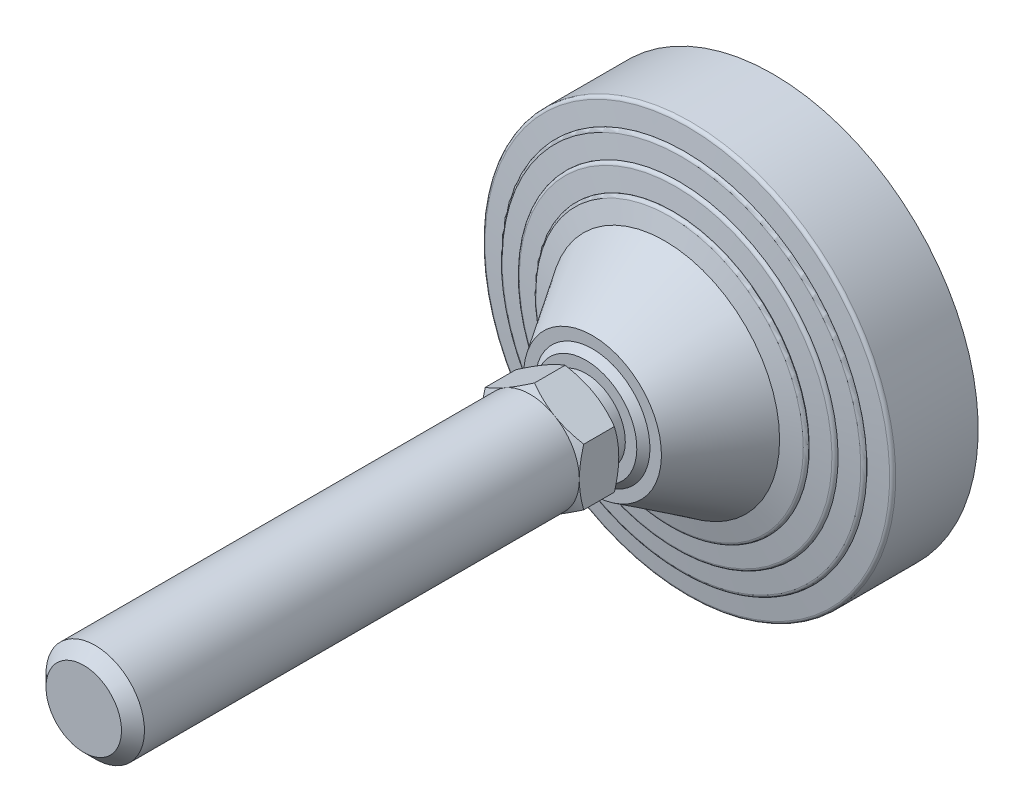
ISO-10303-21;
HEADER;
FILE_DESCRIPTION(('STEP AP214'),'2;1');
FILE_NAME('part.step','',(''),(''),'','','');
FILE_SCHEMA(('AUTOMOTIVE_DESIGN { 1 0 10303 214 1 1 1 1 }'));
ENDSEC;
DATA;
#1=APPLICATION_CONTEXT('core data for automotive mechanical design processes');
#2=APPLICATION_PROTOCOL_DEFINITION('international standard','automotive_design',2000,#1);
#3=PRODUCT_CONTEXT('',#1,'mechanical');
#4=PRODUCT('Part','Part','',(#3));
#5=PRODUCT_RELATED_PRODUCT_CATEGORY('part','',(#4));
#6=PRODUCT_DEFINITION_FORMATION('','',#4);
#7=PRODUCT_DEFINITION_CONTEXT('part definition',#1,'design');
#8=PRODUCT_DEFINITION('design','',#6,#7);
#9=PRODUCT_DEFINITION_SHAPE('','',#8);
#10=(LENGTH_UNIT() NAMED_UNIT(*) SI_UNIT(.MILLI.,.METRE.));
#11=(NAMED_UNIT(*) PLANE_ANGLE_UNIT() SI_UNIT($,.RADIAN.));
#12=(NAMED_UNIT(*) SI_UNIT($,.STERADIAN.) SOLID_ANGLE_UNIT());
#13=UNCERTAINTY_MEASURE_WITH_UNIT(LENGTH_MEASURE(1.E-05),#10,'distance_accuracy_value','');
#14=(GEOMETRIC_REPRESENTATION_CONTEXT(3) GLOBAL_UNCERTAINTY_ASSIGNED_CONTEXT((#13)) GLOBAL_UNIT_ASSIGNED_CONTEXT((#10,
#11,#12)) REPRESENTATION_CONTEXT('',''));
#15=CARTESIAN_POINT('',(0.,0.,0.));
#16=DIRECTION('',(0.,0.,1.));
#17=DIRECTION('',(1.,0.,0.));
#18=AXIS2_PLACEMENT_3D('',#15,#16,#17);
#19=CARTESIAN_POINT('',(-11.9999999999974,0.,62.0000000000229));
#20=DIRECTION('',(0.,0.,1.));
#21=DIRECTION('',(0.,-1.,0.));
#22=AXIS2_PLACEMENT_3D('',#19,#20,#21);
#23=PLANE('',#22);
#24=CARTESIAN_POINT('',(0.,0.,62.0000000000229));
#25=DIRECTION('',(0.,0.,-1.));
#26=DIRECTION('',(0.,1.,0.));
#27=AXIS2_PLACEMENT_3D('',#24,#25,#26);
#28=CIRCLE('',#27,11.9999999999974);
#29=CARTESIAN_POINT('',(0.,11.9999999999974,62.0000000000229));
#30=VERTEX_POINT('',#29);
#31=EDGE_CURVE('E289',#30,#30,#28,.T.);
#32=ORIENTED_EDGE('',*,*,#31,.F.);
#33=EDGE_LOOP('',(#32));
#34=FACE_BOUND('',#33,.T.);
#35=CARTESIAN_POINT('',(0.,0.,62.0000000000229));
#36=DIRECTION('',(0.,0.,1.));
#37=DIRECTION('',(1.,0.,0.));
#38=AXIS2_PLACEMENT_3D('',#35,#36,#37);
#39=CIRCLE('',#38,15.);
#40=CARTESIAN_POINT('',(15.,0.,62.0000000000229));
#41=VERTEX_POINT('',#40);
#42=CARTESIAN_POINT('',(7.5,12.9903810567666,62.0000000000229));
#43=VERTEX_POINT('',#42);
#44=EDGE_CURVE('E107',#41,#43,#39,.T.);
#45=ORIENTED_EDGE('',*,*,#44,.F.);
#46=CARTESIAN_POINT('',(0.,0.,62.0000000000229));
#47=DIRECTION('',(0.,0.,1.));
#48=DIRECTION('',(1.,0.,0.));
#49=AXIS2_PLACEMENT_3D('',#46,#47,#48);
#50=CIRCLE('',#49,15.);
#51=CARTESIAN_POINT('',(7.5,-12.9903810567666,62.0000000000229));
#52=VERTEX_POINT('',#51);
#53=EDGE_CURVE('E18',#52,#41,#50,.T.);
#54=ORIENTED_EDGE('',*,*,#53,.F.);
#55=CARTESIAN_POINT('',(-7.5,-12.9903810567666,62.0000000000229));
#56=VERTEX_POINT('',#55);
#57=EDGE_CURVE('E126',#56,#52,#50,.T.);
#58=ORIENTED_EDGE('',*,*,#57,.F.);
#59=CARTESIAN_POINT('',(-15.,0.,62.0000000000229));
#60=VERTEX_POINT('',#59);
#61=EDGE_CURVE('E731',#60,#56,#50,.T.);
#62=ORIENTED_EDGE('',*,*,#61,.F.);
#63=CARTESIAN_POINT('',(-7.5,12.9903810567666,62.0000000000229));
#64=VERTEX_POINT('',#63);
#65=EDGE_CURVE('E23',#64,#60,#50,.T.);
#66=ORIENTED_EDGE('',*,*,#65,.F.);
#67=EDGE_CURVE('E9',#43,#64,#50,.T.);
#68=ORIENTED_EDGE('',*,*,#67,.F.);
#69=EDGE_LOOP('',(#45,#54,#58,#62,#66,#68));
#70=FACE_BOUND('',#69,.T.);
#71=ADVANCED_FACE('F14',(#34,#70),#23,.F.);
#72=CARTESIAN_POINT('',(0.,0.,0.));
#73=DIRECTION('',(0.,0.,-1.));
#74=DIRECTION('',(0.,1.,0.));
#75=AXIS2_PLACEMENT_3D('',#72,#73,#74);
#76=CYLINDRICAL_SURFACE('',#75,11.9999999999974);
#77=CARTESIAN_POINT('',(0.,0.,57.));
#78=DIRECTION('',(0.,0.,-1.));
#79=DIRECTION('',(0.,1.,0.));
#80=AXIS2_PLACEMENT_3D('',#77,#78,#79);
#81=CIRCLE('',#80,11.9999999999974);
#82=CARTESIAN_POINT('',(0.,11.9999999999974,57.));
#83=VERTEX_POINT('',#82);
#84=EDGE_CURVE('E286',#83,#83,#81,.T.);
#85=ORIENTED_EDGE('',*,*,#84,.F.);
#86=EDGE_LOOP('',(#85));
#87=FACE_BOUND('',#86,.T.);
#88=ORIENTED_EDGE('',*,*,#31,.T.);
#89=EDGE_LOOP('',(#88));
#90=FACE_BOUND('',#89,.T.);
#91=ADVANCED_FACE('F430',(#87,#90),#76,.T.);
#92=CARTESIAN_POINT('',(-11.9999999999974,0.,57.));
#93=DIRECTION('',(0.,0.,-1.));
#94=DIRECTION('',(0.,1.,0.));
#95=AXIS2_PLACEMENT_3D('',#92,#93,#94);
#96=PLANE('',#95);
#97=CARTESIAN_POINT('',(0.,0.,57.));
#98=DIRECTION('',(0.,0.,-1.));
#99=DIRECTION('',(0.,1.,0.));
#100=AXIS2_PLACEMENT_3D('',#97,#98,#99);
#101=CIRCLE('',#100,15.4999999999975);
#102=CARTESIAN_POINT('',(0.,15.4999999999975,57.));
#103=VERTEX_POINT('',#102);
#104=EDGE_CURVE('E283',#103,#103,#101,.T.);
#105=ORIENTED_EDGE('',*,*,#104,.F.);
#106=EDGE_LOOP('',(#105));
#107=FACE_BOUND('',#106,.T.);
#108=ORIENTED_EDGE('',*,*,#84,.T.);
#109=EDGE_LOOP('',(#108));
#110=FACE_BOUND('',#109,.T.);
#111=ADVANCED_FACE('F426',(#107,#110),#96,.F.);
#112=CARTESIAN_POINT('',(0.,0.,57.));
#113=DIRECTION('',(0.,0.,-1.));
#114=DIRECTION('',(0.,1.,0.));
#115=AXIS2_PLACEMENT_3D('',#112,#113,#114);
#116=CONICAL_SURFACE('',#115,15.4999999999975,0.785398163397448);
#117=CARTESIAN_POINT('',(0.,0.,55.));
#118=DIRECTION('',(0.,0.,-1.));
#119=DIRECTION('',(0.,1.,0.));
#120=AXIS2_PLACEMENT_3D('',#117,#118,#119);
#121=CIRCLE('',#120,17.4999999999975);
#122=CARTESIAN_POINT('',(0.,17.4999999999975,55.));
#123=VERTEX_POINT('',#122);
#124=EDGE_CURVE('E280',#123,#123,#121,.T.);
#125=ORIENTED_EDGE('',*,*,#124,.F.);
#126=EDGE_LOOP('',(#125));
#127=FACE_BOUND('',#126,.T.);
#128=ORIENTED_EDGE('',*,*,#104,.T.);
#129=EDGE_LOOP('',(#128));
#130=FACE_BOUND('',#129,.T.);
#131=ADVANCED_FACE('F422',(#127,#130),#116,.T.);
#132=CARTESIAN_POINT('',(-17.4999999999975,0.,55.));
#133=DIRECTION('',(0.,0.,-1.));
#134=DIRECTION('',(0.,1.,0.));
#135=AXIS2_PLACEMENT_3D('',#132,#133,#134);
#136=PLANE('',#135);
#137=CARTESIAN_POINT('',(0.,0.,55.));
#138=DIRECTION('',(0.,0.,-1.));
#139=DIRECTION('',(0.,1.,0.));
#140=AXIS2_PLACEMENT_3D('',#137,#138,#139);
#141=CIRCLE('',#140,20.9999999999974);
#142=CARTESIAN_POINT('',(0.,20.9999999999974,55.));
#143=VERTEX_POINT('',#142);
#144=EDGE_CURVE('E277',#143,#143,#141,.T.);
#145=ORIENTED_EDGE('',*,*,#144,.F.);
#146=EDGE_LOOP('',(#145));
#147=FACE_BOUND('',#146,.T.);
#148=ORIENTED_EDGE('',*,*,#124,.T.);
#149=EDGE_LOOP('',(#148));
#150=FACE_BOUND('',#149,.T.);
#151=ADVANCED_FACE('F418',(#147,#150),#136,.F.);
#152=CARTESIAN_POINT('',(0.,0.,55.));
#153=DIRECTION('',(0.,0.,-1.));
#154=DIRECTION('',(0.,1.,0.));
#155=AXIS2_PLACEMENT_3D('',#152,#153,#154);
#156=CONICAL_SURFACE('',#155,20.9999999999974,0.566729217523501);
#157=CARTESIAN_POINT('',(0.,0.,33.));
#158=DIRECTION('',(0.,0.,-1.));
#159=DIRECTION('',(0.,1.,0.));
#160=AXIS2_PLACEMENT_3D('',#157,#158,#159);
#161=CIRCLE('',#160,34.9999999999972);
#162=CARTESIAN_POINT('',(0.,34.9999999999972,33.));
#163=VERTEX_POINT('',#162);
#164=EDGE_CURVE('E274',#163,#163,#161,.T.);
#165=ORIENTED_EDGE('',*,*,#164,.F.);
#166=EDGE_LOOP('',(#165));
#167=FACE_BOUND('',#166,.T.);
#168=ORIENTED_EDGE('',*,*,#144,.T.);
#169=EDGE_LOOP('',(#168));
#170=FACE_BOUND('',#169,.T.);
#171=ADVANCED_FACE('F414',(#167,#170),#156,.T.);
#172=CARTESIAN_POINT('',(0.,0.,33.));
#173=DIRECTION('',(0.,0.,-1.));
#174=DIRECTION('',(0.,1.,0.));
#175=AXIS2_PLACEMENT_3D('',#172,#173,#174);
#176=CONICAL_SURFACE('',#175,34.9999999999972,1.32154418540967);
#177=CARTESIAN_POINT('',(0.,0.,31.5372089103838));
#178=DIRECTION('',(0.,0.,-1.));
#179=DIRECTION('',(0.,1.,0.));
#180=AXIS2_PLACEMENT_3D('',#177,#178,#179);
#181=CIRCLE('',#180,40.7466792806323);
#182=CARTESIAN_POINT('',(0.,40.7466792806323,31.5372089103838));
#183=VERTEX_POINT('',#182);
#184=EDGE_CURVE('E271',#183,#183,#181,.T.);
#185=ORIENTED_EDGE('',*,*,#184,.F.);
#186=EDGE_LOOP('',(#185));
#187=FACE_BOUND('',#186,.T.);
#188=ORIENTED_EDGE('',*,*,#164,.T.);
#189=EDGE_LOOP('',(#188));
#190=FACE_BOUND('',#189,.T.);
#191=ADVANCED_FACE('F410',(#187,#190),#176,.T.);
#192=CARTESIAN_POINT('',(0.,0.,30.5681117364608));
#193=DIRECTION('',(0.,0.,-1.));
#194=DIRECTION('',(0.,1.,0.));
#195=AXIS2_PLACEMENT_3D('',#192,#193,#194);
#196=TOROIDAL_SURFACE('',#195,40.4999999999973,1.);
#197=CARTESIAN_POINT('',(0.,0.,30.5681117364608));
#198=DIRECTION('',(0.,0.,-1.));
#199=DIRECTION('',(0.,1.,0.));
#200=AXIS2_PLACEMENT_3D('',#197,#198,#199);
#201=CIRCLE('',#200,41.4999999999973);
#202=CARTESIAN_POINT('',(0.,41.4999999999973,30.5681117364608));
#203=VERTEX_POINT('',#202);
#204=EDGE_CURVE('E268',#203,#203,#201,.T.);
#205=ORIENTED_EDGE('',*,*,#204,.F.);
#206=EDGE_LOOP('',(#205));
#207=FACE_BOUND('',#206,.T.);
#208=ORIENTED_EDGE('',*,*,#184,.T.);
#209=EDGE_LOOP('',(#208));
#210=FACE_BOUND('',#209,.T.);
#211=ADVANCED_FACE('F406',(#207,#210),#196,.T.);
#212=CARTESIAN_POINT('',(0.,0.,0.));
#213=DIRECTION('',(0.,0.,-1.));
#214=DIRECTION('',(0.,1.,0.));
#215=AXIS2_PLACEMENT_3D('',#212,#213,#214);
#216=CYLINDRICAL_SURFACE('',#215,41.4999999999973);
#217=CARTESIAN_POINT('',(0.,0.,30.4545454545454));
#218=DIRECTION('',(0.,0.,-1.));
#219=DIRECTION('',(0.,1.,0.));
#220=AXIS2_PLACEMENT_3D('',#217,#218,#219);
#221=CIRCLE('',#220,41.4999999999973);
#222=CARTESIAN_POINT('',(0.,41.4999999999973,30.4545454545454));
#223=VERTEX_POINT('',#222);
#224=EDGE_CURVE('E265',#223,#223,#221,.T.);
#225=ORIENTED_EDGE('',*,*,#224,.F.);
#226=EDGE_LOOP('',(#225));
#227=FACE_BOUND('',#226,.T.);
#228=ORIENTED_EDGE('',*,*,#204,.T.);
#229=EDGE_LOOP('',(#228));
#230=FACE_BOUND('',#229,.T.);
#231=ADVANCED_FACE('F402',(#227,#230),#216,.T.);
#232=CARTESIAN_POINT('',(0.,0.,30.4545454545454));
#233=DIRECTION('',(0.,0.,-1.));
#234=DIRECTION('',(0.,1.,0.));
#235=AXIS2_PLACEMENT_3D('',#232,#233,#234);
#236=CONICAL_SURFACE('',#235,41.4999999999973,1.44420419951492);
#237=CARTESIAN_POINT('',(0.,0.,29.674840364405));
#238=DIRECTION('',(0.,0.,-1.));
#239=DIRECTION('',(0.,1.,0.));
#240=AXIS2_PLACEMENT_3D('',#237,#238,#239);
#241=CIRCLE('',#240,47.6262542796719);
#242=CARTESIAN_POINT('',(0.,47.6262542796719,29.674840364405));
#243=VERTEX_POINT('',#242);
#244=EDGE_CURVE('E262',#243,#243,#241,.T.);
#245=ORIENTED_EDGE('',*,*,#244,.F.);
#246=EDGE_LOOP('',(#245));
#247=FACE_BOUND('',#246,.T.);
#248=ORIENTED_EDGE('',*,*,#224,.T.);
#249=EDGE_LOOP('',(#248));
#250=FACE_BOUND('',#249,.T.);
#251=ADVANCED_FACE('F398',(#247,#250),#236,.T.);
#252=CARTESIAN_POINT('',(0.,0.,28.6828424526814));
#253=DIRECTION('',(0.,0.,-1.));
#254=DIRECTION('',(0.,1.,0.));
#255=AXIS2_PLACEMENT_3D('',#252,#253,#254);
#256=TOROIDAL_SURFACE('',#255,47.499999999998,1.);
#257=CARTESIAN_POINT('',(0.,0.,28.6828424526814));
#258=DIRECTION('',(0.,0.,-1.));
#259=DIRECTION('',(0.,1.,0.));
#260=AXIS2_PLACEMENT_3D('',#257,#258,#259);
#261=CIRCLE('',#260,48.499999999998);
#262=CARTESIAN_POINT('',(0.,48.499999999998,28.6828424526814));
#263=VERTEX_POINT('',#262);
#264=EDGE_CURVE('E259',#263,#263,#261,.T.);
#265=ORIENTED_EDGE('',*,*,#264,.F.);
#266=EDGE_LOOP('',(#265));
#267=FACE_BOUND('',#266,.T.);
#268=ORIENTED_EDGE('',*,*,#244,.T.);
#269=EDGE_LOOP('',(#268));
#270=FACE_BOUND('',#269,.T.);
#271=ADVANCED_FACE('F394',(#267,#270),#256,.T.);
#272=CARTESIAN_POINT('',(0.,0.,0.));
#273=DIRECTION('',(0.,0.,-1.));
#274=DIRECTION('',(0.,1.,0.));
#275=AXIS2_PLACEMENT_3D('',#272,#273,#274);
#276=CYLINDRICAL_SURFACE('',#275,48.499999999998);
#277=CARTESIAN_POINT('',(0.,0.,28.6727272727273));
#278=DIRECTION('',(0.,0.,-1.));
#279=DIRECTION('',(0.,1.,0.));
#280=AXIS2_PLACEMENT_3D('',#277,#278,#279);
#281=CIRCLE('',#280,48.499999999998);
#282=CARTESIAN_POINT('',(0.,48.499999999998,28.6727272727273));
#283=VERTEX_POINT('',#282);
#284=EDGE_CURVE('E256',#283,#283,#281,.T.);
#285=ORIENTED_EDGE('',*,*,#284,.F.);
#286=EDGE_LOOP('',(#285));
#287=FACE_BOUND('',#286,.T.);
#288=ORIENTED_EDGE('',*,*,#264,.T.);
#289=EDGE_LOOP('',(#288));
#290=FACE_BOUND('',#289,.T.);
#291=ADVANCED_FACE('F390',(#287,#290),#276,.T.);
#292=CARTESIAN_POINT('',(0.,0.,28.6727272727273));
#293=DIRECTION('',(0.,0.,-1.));
#294=DIRECTION('',(0.,1.,0.));
#295=AXIS2_PLACEMENT_3D('',#292,#293,#294);
#296=CONICAL_SURFACE('',#295,48.499999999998,1.44420419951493);
#297=CARTESIAN_POINT('',(0.,0.,27.8930221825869));
#298=DIRECTION('',(0.,0.,-1.));
#299=DIRECTION('',(0.,1.,0.));
#300=AXIS2_PLACEMENT_3D('',#297,#298,#299);
#301=CIRCLE('',#300,54.6262542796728);
#302=CARTESIAN_POINT('',(0.,54.6262542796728,27.8930221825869));
#303=VERTEX_POINT('',#302);
#304=EDGE_CURVE('E253',#303,#303,#301,.T.);
#305=ORIENTED_EDGE('',*,*,#304,.F.);
#306=EDGE_LOOP('',(#305));
#307=FACE_BOUND('',#306,.T.);
#308=ORIENTED_EDGE('',*,*,#284,.T.);
#309=EDGE_LOOP('',(#308));
#310=FACE_BOUND('',#309,.T.);
#311=ADVANCED_FACE('F386',(#307,#310),#296,.T.);
#312=CARTESIAN_POINT('',(0.,0.,26.9010242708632));
#313=DIRECTION('',(0.,0.,-1.));
#314=DIRECTION('',(0.,1.,0.));
#315=AXIS2_PLACEMENT_3D('',#312,#313,#314);
#316=TOROIDAL_SURFACE('',#315,54.4999999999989,1.);
#317=CARTESIAN_POINT('',(0.,0.,26.9010242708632));
#318=DIRECTION('',(0.,0.,-1.));
#319=DIRECTION('',(0.,1.,0.));
#320=AXIS2_PLACEMENT_3D('',#317,#318,#319);
#321=CIRCLE('',#320,55.4999999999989);
#322=CARTESIAN_POINT('',(0.,55.4999999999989,26.9010242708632));
#323=VERTEX_POINT('',#322);
#324=EDGE_CURVE('E250',#323,#323,#321,.T.);
#325=ORIENTED_EDGE('',*,*,#324,.F.);
#326=EDGE_LOOP('',(#325));
#327=FACE_BOUND('',#326,.T.);
#328=ORIENTED_EDGE('',*,*,#304,.T.);
#329=EDGE_LOOP('',(#328));
#330=FACE_BOUND('',#329,.T.);
#331=ADVANCED_FACE('F382',(#327,#330),#316,.T.);
#332=CARTESIAN_POINT('',(0.,0.,0.));
#333=DIRECTION('',(0.,0.,-1.));
#334=DIRECTION('',(0.,1.,0.));
#335=AXIS2_PLACEMENT_3D('',#332,#333,#334);
#336=CYLINDRICAL_SURFACE('',#335,55.4999999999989);
#337=CARTESIAN_POINT('',(0.,0.,26.8909090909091));
#338=DIRECTION('',(0.,0.,-1.));
#339=DIRECTION('',(0.,1.,0.));
#340=AXIS2_PLACEMENT_3D('',#337,#338,#339);
#341=CIRCLE('',#340,55.4999999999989);
#342=CARTESIAN_POINT('',(0.,55.4999999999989,26.8909090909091));
#343=VERTEX_POINT('',#342);
#344=EDGE_CURVE('E247',#343,#343,#341,.T.);
#345=ORIENTED_EDGE('',*,*,#344,.F.);
#346=EDGE_LOOP('',(#345));
#347=FACE_BOUND('',#346,.T.);
#348=ORIENTED_EDGE('',*,*,#324,.T.);
#349=EDGE_LOOP('',(#348));
#350=FACE_BOUND('',#349,.T.);
#351=ADVANCED_FACE('F378',(#347,#350),#336,.T.);
#352=CARTESIAN_POINT('',(0.,0.,26.8909090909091));
#353=DIRECTION('',(0.,0.,-1.));
#354=DIRECTION('',(0.,1.,0.));
#355=AXIS2_PLACEMENT_3D('',#352,#353,#354);
#356=CONICAL_SURFACE('',#355,55.4999999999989,1.44420419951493);
#357=CARTESIAN_POINT('',(0.,0.,26.1112040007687));
#358=DIRECTION('',(0.,0.,-1.));
#359=DIRECTION('',(0.,1.,0.));
#360=AXIS2_PLACEMENT_3D('',#357,#358,#359);
#361=CIRCLE('',#360,61.6262542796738);
#362=CARTESIAN_POINT('',(0.,61.6262542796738,26.1112040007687));
#363=VERTEX_POINT('',#362);
#364=EDGE_CURVE('E244',#363,#363,#361,.T.);
#365=ORIENTED_EDGE('',*,*,#364,.F.);
#366=EDGE_LOOP('',(#365));
#367=FACE_BOUND('',#366,.T.);
#368=ORIENTED_EDGE('',*,*,#344,.T.);
#369=EDGE_LOOP('',(#368));
#370=FACE_BOUND('',#369,.T.);
#371=ADVANCED_FACE('F374',(#367,#370),#356,.T.);
#372=CARTESIAN_POINT('',(0.,0.,25.1192060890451));
#373=DIRECTION('',(0.,0.,-1.));
#374=DIRECTION('',(0.,1.,0.));
#375=AXIS2_PLACEMENT_3D('',#372,#373,#374);
#376=TOROIDAL_SURFACE('',#375,61.5,1.);
#377=CARTESIAN_POINT('',(0.,0.,25.1192060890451));
#378=DIRECTION('',(0.,0.,-1.));
#379=DIRECTION('',(0.,1.,0.));
#380=AXIS2_PLACEMENT_3D('',#377,#378,#379);
#381=CIRCLE('',#380,62.5);
#382=CARTESIAN_POINT('',(0.,62.5,25.1192060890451));
#383=VERTEX_POINT('',#382);
#384=EDGE_CURVE('E241',#383,#383,#381,.T.);
#385=ORIENTED_EDGE('',*,*,#384,.F.);
#386=EDGE_LOOP('',(#385));
#387=FACE_BOUND('',#386,.T.);
#388=ORIENTED_EDGE('',*,*,#364,.T.);
#389=EDGE_LOOP('',(#388));
#390=FACE_BOUND('',#389,.T.);
#391=ADVANCED_FACE('F370',(#387,#390),#376,.T.);
#392=CARTESIAN_POINT('',(0.,0.,0.));
#393=DIRECTION('',(0.,0.,-1.));
#394=DIRECTION('',(0.,1.,0.));
#395=AXIS2_PLACEMENT_3D('',#392,#393,#394);
#396=CYLINDRICAL_SURFACE('',#395,62.5);
#397=CARTESIAN_POINT('',(0.,0.,0.));
#398=DIRECTION('',(0.,0.,-1.));
#399=DIRECTION('',(0.,1.,0.));
#400=AXIS2_PLACEMENT_3D('',#397,#398,#399);
#401=CIRCLE('',#400,62.5);
#402=CARTESIAN_POINT('',(0.,62.5,0.));
#403=VERTEX_POINT('',#402);
#404=EDGE_CURVE('E226',#403,#403,#401,.T.);
#405=ORIENTED_EDGE('',*,*,#404,.F.);
#406=EDGE_LOOP('',(#405));
#407=FACE_BOUND('',#406,.T.);
#408=ORIENTED_EDGE('',*,*,#384,.T.);
#409=EDGE_LOOP('',(#408));
#410=FACE_BOUND('',#409,.T.);
#411=ADVANCED_FACE('F366',(#407,#410),#396,.T.);
#412=CARTESIAN_POINT('',(0.,0.,0.));
#413=DIRECTION('',(0.,0.,1.));
#414=DIRECTION('',(0.,-1.,0.));
#415=AXIS2_PLACEMENT_3D('',#412,#413,#414);
#416=PLANE('',#415);
#417=ORIENTED_EDGE('',*,*,#404,.T.);
#418=EDGE_LOOP('',(#417));
#419=FACE_BOUND('',#418,.T.);
#420=ADVANCED_FACE('F358',(#419),#416,.F.);
#421=CARTESIAN_POINT('',(0.,0.,63.8964842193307));
#422=DIRECTION('',(0.,0.,1.));
#423=DIRECTION('',(1.,0.,0.));
#424=AXIS2_PLACEMENT_3D('',#421,#422,#423);
#425=CONICAL_SURFACE('',#424,18.2848070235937,1.0471975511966);
#426=ORIENTED_EDGE('',*,*,#53,.T.);
#427=CARTESIAN_POINT('',(15.,-23.0455805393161,69.2152909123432));
#428=CARTESIAN_POINT('',(15.,-22.7189132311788,69.0572263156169));
#429=CARTESIAN_POINT('',(15.,-22.3918566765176,68.8999665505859));
#430=CARTESIAN_POINT('',(15.,-21.7368837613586,68.5872394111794));
#431=CARTESIAN_POINT('',(15.,-21.4089673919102,68.4317720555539));
#432=CARTESIAN_POINT('',(15.,-20.4237162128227,67.968290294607));
#433=CARTESIAN_POINT('',(15.,-19.7649793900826,67.6632447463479));
#434=CARTESIAN_POINT('',(15.,-18.4393339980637,67.0612678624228));
#435=CARTESIAN_POINT('',(15.,-17.7724003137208,66.7643916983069));
#436=CARTESIAN_POINT('',(15.,-16.433152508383,66.1830772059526));
#437=CARTESIAN_POINT('',(15.,-15.7608386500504,65.8986382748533));
#438=CARTESIAN_POINT('',(15.,-14.3889088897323,65.3369598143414));
#439=CARTESIAN_POINT('',(15.,-13.6890903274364,65.0602126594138));
#440=CARTESIAN_POINT('',(15.,-12.2811809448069,64.5281930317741));
#441=CARTESIAN_POINT('',(15.,-11.5730891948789,64.2729229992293));
#442=CARTESIAN_POINT('',(15.,-10.1489276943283,63.790722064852));
#443=CARTESIAN_POINT('',(15.,-9.43287818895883,63.5637318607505));
#444=CARTESIAN_POINT('',(15.,-7.99044250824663,63.1455054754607));
#445=CARTESIAN_POINT('',(15.,-7.26405973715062,62.9542577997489));
#446=CARTESIAN_POINT('',(15.,-6.16862523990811,62.7017388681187));
#447=CARTESIAN_POINT('',(15.,-5.80347052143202,62.6234523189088));
#448=CARTESIAN_POINT('',(15.,-5.07070780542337,62.4792835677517));
#449=CARTESIAN_POINT('',(15.,-4.70309986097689,62.4134010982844));
#450=CARTESIAN_POINT('',(15.,-3.96569893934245,62.2952160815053));
#451=CARTESIAN_POINT('',(15.,-3.5959059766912,62.2429134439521));
#452=CARTESIAN_POINT('',(15.,-2.85454574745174,62.1529393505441));
#453=CARTESIAN_POINT('',(15.,-2.48297854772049,62.1152673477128));
#454=CARTESIAN_POINT('',(15.,-1.74334360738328,62.055763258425));
#455=CARTESIAN_POINT('',(15.,-1.37529173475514,62.0337351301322));
#456=CARTESIAN_POINT('',(15.,-0.638587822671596,62.005247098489));
#457=CARTESIAN_POINT('',(15.,-0.269935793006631,61.998786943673));
#458=CARTESIAN_POINT('',(15.,0.467313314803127,62.0015879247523));
#459=CARTESIAN_POINT('',(15.,0.835910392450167,62.0108491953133));
#460=CARTESIAN_POINT('',(15.,1.57239318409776,62.0448709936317));
#461=CARTESIAN_POINT('',(15.,1.94027886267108,62.0696322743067));
#462=CARTESIAN_POINT('',(15.,2.83111612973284,62.1478421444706));
#463=CARTESIAN_POINT('',(15.,3.35340089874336,62.2090161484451));
#464=CARTESIAN_POINT('',(15.,4.39395261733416,62.3592197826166));
#465=CARTESIAN_POINT('',(15.,4.91221898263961,62.4482533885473));
#466=CARTESIAN_POINT('',(15.,5.94428930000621,62.6510084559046));
#467=CARTESIAN_POINT('',(15.,6.45808929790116,62.7647498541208));
#468=CARTESIAN_POINT('',(15.,7.4804668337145,63.0134623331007));
#469=CARTESIAN_POINT('',(15.,7.9890444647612,63.1484330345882));
#470=CARTESIAN_POINT('',(15.,9.0119945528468,63.4394761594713));
#471=CARTESIAN_POINT('',(15.,9.52625431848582,63.595941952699));
#472=CARTESIAN_POINT('',(15.,10.5497062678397,63.9245687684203));
#473=CARTESIAN_POINT('',(15.,11.0588984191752,64.0967298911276));
#474=CARTESIAN_POINT('',(15.,12.0724746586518,64.4540553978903));
#475=CARTESIAN_POINT('',(15.,12.5768603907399,64.6392151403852));
#476=CARTESIAN_POINT('',(15.,13.5814845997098,65.0204059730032));
#477=CARTESIAN_POINT('',(15.,14.0817231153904,65.216436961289));
#478=CARTESIAN_POINT('',(15.,15.2198032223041,65.6744096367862));
#479=CARTESIAN_POINT('',(15.,15.8564620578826,65.9392852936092));
#480=CARTESIAN_POINT('',(15.,17.1247059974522,66.4809489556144));
#481=CARTESIAN_POINT('',(15.,17.7562908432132,66.7577375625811));
#482=CARTESIAN_POINT('',(15.,19.0152783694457,67.3209532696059));
#483=CARTESIAN_POINT('',(15.,19.6426802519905,67.6073821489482));
#484=CARTESIAN_POINT('',(15.,20.8938482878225,68.188028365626));
#485=CARTESIAN_POINT('',(15.,21.5176145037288,68.4822455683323));
#486=CARTESIAN_POINT('',(15.,22.7626803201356,69.0773613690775));
#487=CARTESIAN_POINT('',(15.,23.3839769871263,69.3782660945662));
#488=CARTESIAN_POINT('',(15.,24.6239696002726,69.9853857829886));
#489=CARTESIAN_POINT('',(15.,25.2426655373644,70.2916007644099));
#490=CARTESIAN_POINT('',(15.,26.4777729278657,70.9084345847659));
#491=CARTESIAN_POINT('',(15.,27.0941846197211,71.2190529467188));
#492=CARTESIAN_POINT('',(15.,28.3251078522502,71.844034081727));
#493=CARTESIAN_POINT('',(15.,28.9396193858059,72.1583968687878));
#494=CARTESIAN_POINT('',(15.,30.6847068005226,73.0568127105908));
#495=CARTESIAN_POINT('',(15.,31.8133268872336,73.6446648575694));
#496=CARTESIAN_POINT('',(15.,34.0663345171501,74.8284860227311));
#497=CARTESIAN_POINT('',(15.,35.1907219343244,75.4244552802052));
#498=CARTESIAN_POINT('',(15.,37.4336617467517,76.6213277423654));
#499=CARTESIAN_POINT('',(15.,38.5522215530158,77.2222170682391));
#500=CARTESIAN_POINT('',(15.,40.2280424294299,78.1272196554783));
#501=CARTESIAN_POINT('',(15.,40.7862995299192,78.4294913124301));
#502=CARTESIAN_POINT('',(15.,41.9022142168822,79.0351372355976));
#503=CARTESIAN_POINT('',(15.,42.4598718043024,79.3385115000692));
#504=CARTESIAN_POINT('',(15.,43.0172627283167,79.6423750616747));
#505=B_SPLINE_CURVE_WITH_KNOTS('',3,(#427,#428,#429,#430,#431,#432,#433,#434,#435,#436,#437,
#438,#439,#440,#441,#442,#443,#444,#445,#446,#447,#448,#449,#450,#451,#452,#453,#454,#455,#456,
#457,#458,#459,#460,#461,#462,#463,#464,#465,#466,#467,#468,#469,#470,#471,#472,#473,#474,#475,
#476,#477,#478,#479,#480,#481,#482,#483,#484,#485,#486,#487,#488,#489,#490,#491,#492,#493,#494,
#495,#496,#497,#498,#499,#500,#501,#502,#503,#504),.UNSPECIFIED.,.F.,.F.,(4,2,2,2,2,2,2,2,2,2,2,
2,2,2,2,2,2,2,2,2,2,2,2,2,2,2,2,2,2,2,2,2,2,2,2,2,2,2,4),(0.,1.08869604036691,2.17740345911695,
4.35515192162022,6.54512706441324,8.73499593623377,10.9923838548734,13.2500279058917,
15.5028550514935,17.7549564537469,18.8751372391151,19.9952938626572,21.1154430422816,
22.2355503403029,23.3413606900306,24.4471531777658,25.5529551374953,26.6588108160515,
28.2354988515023,29.812411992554,31.3906023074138,32.9687644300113,34.5810711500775,
36.1933881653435,37.8051323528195,39.4168614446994,41.4853825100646,43.5540081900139,
45.623017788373,47.6919916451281,49.7629464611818,51.8339084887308,53.9046478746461,
55.9753950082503,59.7929600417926,63.6106378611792,67.4198463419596,69.3243590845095,
71.2288688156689),.UNSPECIFIED.);
#506=CARTESIAN_POINT('',(15.,-8.66025403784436,63.3397459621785));
#507=VERTEX_POINT('',#506);
#508=EDGE_CURVE('E115',#507,#41,#505,.T.);
#509=ORIENTED_EDGE('',*,*,#508,.F.);
#510=CARTESIAN_POINT('',(-0.000199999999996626,-17.3206235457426,63.3398126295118));
#511=CARTESIAN_POINT('',(0.329494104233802,-17.130274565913,63.2299217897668));
#512=CARTESIAN_POINT('',(0.6604741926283,-16.939183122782,63.1250175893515));
#513=CARTESIAN_POINT('',(1.32508844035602,-16.5554679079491,62.926568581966));
#514=CARTESIAN_POINT('',(1.6587234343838,-16.3628436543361,62.8330275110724));
#515=CARTESIAN_POINT('',(2.32929228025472,-15.9756905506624,62.6585621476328));
#516=CARTESIAN_POINT('',(2.66623200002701,-15.7811583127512,62.5776677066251));
#517=CARTESIAN_POINT('',(3.34245276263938,-15.3907420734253,62.430232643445));
#518=CARTESIAN_POINT('',(3.68173367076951,-15.1948581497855,62.3636912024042));
#519=CARTESIAN_POINT('',(4.35394314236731,-14.8067578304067,62.2477923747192));
#520=CARTESIAN_POINT('',(4.68682180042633,-14.6145702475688,62.1980513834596));
#521=CARTESIAN_POINT('',(5.35410443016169,-14.2293144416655,62.1146467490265));
#522=CARTESIAN_POINT('',(5.68850843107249,-14.0362462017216,62.080983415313));
#523=CARTESIAN_POINT('',(6.35787818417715,-13.6497853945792,62.030584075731));
#524=CARTESIAN_POINT('',(6.69284279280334,-13.4563934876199,62.013827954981));
#525=CARTESIAN_POINT('',(7.36308121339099,-13.0694311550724,61.9976033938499));
#526=CARTESIAN_POINT('',(7.69835501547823,-12.8758607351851,61.9981344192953));
#527=CARTESIAN_POINT('',(8.32514688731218,-12.5139822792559,62.015276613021));
#528=CARTESIAN_POINT('',(8.61670962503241,-12.3456484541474,62.0297968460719));
#529=CARTESIAN_POINT('',(9.19916443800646,-12.0093680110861,62.0716371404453));
#530=CARTESIAN_POINT('',(9.49005646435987,-11.8414214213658,62.0989581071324));
#531=CARTESIAN_POINT('',(10.0710118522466,-11.5060066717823,62.1659235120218));
#532=CARTESIAN_POINT('',(10.3610743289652,-11.338539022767,62.2055781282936));
#533=CARTESIAN_POINT('',(10.939839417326,-11.0043888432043,62.2965151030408));
#534=CARTESIAN_POINT('',(11.2285419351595,-10.8377063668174,62.3477982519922));
#535=CARTESIAN_POINT('',(12.1049144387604,-10.331732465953,62.52038686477));
#536=CARTESIAN_POINT('',(12.6900465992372,-9.99390625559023,62.6589011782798));
#537=CARTESIAN_POINT('',(13.8515859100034,-9.32329122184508,62.9732719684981));
#538=CARTESIAN_POINT('',(14.4280079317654,-8.99049381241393,63.1490546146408));
#539=CARTESIAN_POINT('',(15.0002,-8.66013856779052,63.3398126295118));
#540=B_SPLINE_CURVE_WITH_KNOTS('',3,(#510,#511,#512,#513,#514,#515,#516,#517,#518,#519,#520,
#521,#522,#523,#524,#525,#526,#527,#528,#529,#530,#531,#532,#533,#534,#535,#536,#537,#538,#539),
.UNSPECIFIED.,.F.,.F.,(4,2,2,2,2,2,2,2,2,2,2,2,2,2,4),(0.,1.18875411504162,2.37789802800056,
3.56980778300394,4.76164951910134,5.92407379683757,7.0865204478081,8.24758247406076,
9.40860862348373,10.4193068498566,11.4300765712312,12.4416826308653,13.4533574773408,
15.5211962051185,17.584976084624),.UNSPECIFIED.);
#541=EDGE_CURVE('E122',#52,#507,#540,.T.);
#542=ORIENTED_EDGE('',*,*,#541,.F.);
#543=EDGE_LOOP('',(#426,#509,#542));
#544=FACE_BOUND('',#543,.T.);
#545=ADVANCED_FACE('F120',(#544),#425,.T.);
#546=ORIENTED_EDGE('',*,*,#57,.T.);
#547=CARTESIAN_POINT('',(0.,-17.3205080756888,63.3397459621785));
#548=VERTEX_POINT('',#547);
#549=EDGE_CURVE('E135',#548,#52,#540,.T.);
#550=ORIENTED_EDGE('',*,*,#549,.F.);
#551=CARTESIAN_POINT('',(-15.0002,-8.66013856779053,63.3398126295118));
#552=CARTESIAN_POINT('',(-14.6705058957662,-8.85048754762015,63.2299217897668));
#553=CARTESIAN_POINT('',(-14.3395258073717,-9.04157899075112,63.1250175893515));
#554=CARTESIAN_POINT('',(-13.674911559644,-9.42529420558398,62.926568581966));
#555=CARTESIAN_POINT('',(-13.3412765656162,-9.617918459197,62.8330275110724));
#556=CARTESIAN_POINT('',(-12.6707077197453,-10.0050715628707,62.6585621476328));
#557=CARTESIAN_POINT('',(-12.333767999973,-10.199603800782,62.5776677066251));
#558=CARTESIAN_POINT('',(-11.6575472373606,-10.5900200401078,62.430232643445));
#559=CARTESIAN_POINT('',(-11.3182663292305,-10.7859039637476,62.3636912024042));
#560=CARTESIAN_POINT('',(-10.6460568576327,-11.1740042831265,62.2477923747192));
#561=CARTESIAN_POINT('',(-10.3131781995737,-11.3661918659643,62.1980513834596));
#562=CARTESIAN_POINT('',(-9.64589556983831,-11.7514476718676,62.1146467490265));
#563=CARTESIAN_POINT('',(-9.31149156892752,-11.9445159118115,62.080983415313));
#564=CARTESIAN_POINT('',(-8.64212181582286,-12.3309767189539,62.030584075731));
#565=CARTESIAN_POINT('',(-8.30715720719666,-12.5243686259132,62.013827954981));
#566=CARTESIAN_POINT('',(-7.63691878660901,-12.9113309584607,61.9976033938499));
#567=CARTESIAN_POINT('',(-7.30164498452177,-13.104901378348,61.9981344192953));
#568=CARTESIAN_POINT('',(-6.67485311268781,-13.4667798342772,62.015276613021));
#569=CARTESIAN_POINT('',(-6.3832903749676,-13.6351136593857,62.0297968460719));
#570=CARTESIAN_POINT('',(-5.80083556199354,-13.971394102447,62.0716371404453));
#571=CARTESIAN_POINT('',(-5.50994353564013,-14.1393406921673,62.0989581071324));
#572=CARTESIAN_POINT('',(-4.92898814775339,-14.4747554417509,62.1659235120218));
#573=CARTESIAN_POINT('',(-4.63892567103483,-14.6422230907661,62.2055781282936));
#574=CARTESIAN_POINT('',(-4.06016058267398,-14.9763732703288,62.2965151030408));
#575=CARTESIAN_POINT('',(-3.77145806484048,-15.1430557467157,62.3477982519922));
#576=CARTESIAN_POINT('',(-2.8950855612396,-15.6490296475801,62.52038686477));
#577=CARTESIAN_POINT('',(-2.30995340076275,-15.9868558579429,62.6589011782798));
#578=CARTESIAN_POINT('',(-1.14841408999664,-16.657470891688,62.9732719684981));
#579=CARTESIAN_POINT('',(-0.571992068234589,-16.9902683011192,63.1490546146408));
#580=CARTESIAN_POINT('',(0.000200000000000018,-17.3206235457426,63.3398126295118));
#581=B_SPLINE_CURVE_WITH_KNOTS('',3,(#551,#552,#553,#554,#555,#556,#557,#558,#559,#560,#561,
#562,#563,#564,#565,#566,#567,#568,#569,#570,#571,#572,#573,#574,#575,#576,#577,#578,#579,#580),
.UNSPECIFIED.,.F.,.F.,(4,2,2,2,2,2,2,2,2,2,2,2,2,2,4),(0.,1.18875411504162,2.37789802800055,
3.56980778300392,4.76164951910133,5.92407379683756,7.08652044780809,8.24758247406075,
9.40860862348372,10.4193068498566,11.4300765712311,12.4416826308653,13.4533574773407,
15.5211962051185,17.584976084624),.UNSPECIFIED.);
#582=EDGE_CURVE('E169',#56,#548,#581,.T.);
#583=ORIENTED_EDGE('',*,*,#582,.F.);
#584=EDGE_LOOP('',(#546,#550,#583));
#585=FACE_BOUND('',#584,.T.);
#586=ADVANCED_FACE('F485',(#585),#425,.T.);
#587=ORIENTED_EDGE('',*,*,#61,.T.);
#588=CARTESIAN_POINT('',(-15.,-8.66025403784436,63.3397459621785));
#589=VERTEX_POINT('',#588);
#590=EDGE_CURVE('E183',#589,#56,#581,.T.);
#591=ORIENTED_EDGE('',*,*,#590,.F.);
#592=CARTESIAN_POINT('',(-15.,-23.0455805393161,69.2152909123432));
#593=CARTESIAN_POINT('',(-15.,-22.7189132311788,69.0572263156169));
#594=CARTESIAN_POINT('',(-15.,-22.3918566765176,68.8999665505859));
#595=CARTESIAN_POINT('',(-15.,-21.7368837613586,68.5872394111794));
#596=CARTESIAN_POINT('',(-15.,-21.4089673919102,68.4317720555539));
#597=CARTESIAN_POINT('',(-15.,-20.4237162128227,67.968290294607));
#598=CARTESIAN_POINT('',(-15.,-19.7649793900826,67.6632447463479));
#599=CARTESIAN_POINT('',(-15.,-18.4393339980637,67.0612678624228));
#600=CARTESIAN_POINT('',(-15.,-17.7724003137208,66.7643916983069));
#601=CARTESIAN_POINT('',(-15.,-16.433152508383,66.1830772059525));
#602=CARTESIAN_POINT('',(-15.,-15.7608386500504,65.8986382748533));
#603=CARTESIAN_POINT('',(-15.,-14.3889088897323,65.3369598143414));
#604=CARTESIAN_POINT('',(-15.,-13.6890903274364,65.0602126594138));
#605=CARTESIAN_POINT('',(-15.,-12.2811809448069,64.5281930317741));
#606=CARTESIAN_POINT('',(-15.,-11.5730891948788,64.2729229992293));
#607=CARTESIAN_POINT('',(-15.,-10.1489276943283,63.790722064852));
#608=CARTESIAN_POINT('',(-15.,-9.43287818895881,63.5637318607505));
#609=CARTESIAN_POINT('',(-15.,-7.99044250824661,63.1455054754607));
#610=CARTESIAN_POINT('',(-15.,-7.2640597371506,62.9542577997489));
#611=CARTESIAN_POINT('',(-15.,-6.16862523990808,62.7017388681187));
#612=CARTESIAN_POINT('',(-15.,-5.803470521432,62.6234523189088));
#613=CARTESIAN_POINT('',(-15.,-5.07070780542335,62.4792835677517));
#614=CARTESIAN_POINT('',(-15.,-4.70309986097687,62.4134010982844));
#615=CARTESIAN_POINT('',(-15.,-3.96569893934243,62.2952160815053));
#616=CARTESIAN_POINT('',(-15.,-3.59590597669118,62.2429134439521));
#617=CARTESIAN_POINT('',(-15.,-2.85454574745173,62.1529393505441));
#618=CARTESIAN_POINT('',(-15.,-2.48297854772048,62.1152673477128));
#619=CARTESIAN_POINT('',(-15.,-1.74334360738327,62.055763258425));
#620=CARTESIAN_POINT('',(-15.,-1.37529173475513,62.0337351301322));
#621=CARTESIAN_POINT('',(-15.,-0.638587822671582,62.005247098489));
#622=CARTESIAN_POINT('',(-15.,-0.269935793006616,61.998786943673));
#623=CARTESIAN_POINT('',(-15.,0.46731331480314,62.0015879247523));
#624=CARTESIAN_POINT('',(-15.,0.835910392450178,62.0108491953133));
#625=CARTESIAN_POINT('',(-15.,1.57239318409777,62.0448709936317));
#626=CARTESIAN_POINT('',(-15.,1.94027886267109,62.0696322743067));
#627=CARTESIAN_POINT('',(-15.,2.83111612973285,62.1478421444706));
#628=CARTESIAN_POINT('',(-15.,3.35340089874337,62.2090161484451));
#629=CARTESIAN_POINT('',(-15.,4.39395261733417,62.3592197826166));
#630=CARTESIAN_POINT('',(-15.,4.91221898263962,62.4482533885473));
#631=CARTESIAN_POINT('',(-15.,5.94428930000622,62.6510084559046));
#632=CARTESIAN_POINT('',(-15.,6.45808929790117,62.7647498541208));
#633=CARTESIAN_POINT('',(-15.,7.48046683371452,63.0134623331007));
#634=CARTESIAN_POINT('',(-15.,7.98904446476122,63.1484330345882));
#635=CARTESIAN_POINT('',(-15.,9.01199455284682,63.4394761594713));
#636=CARTESIAN_POINT('',(-15.,9.52625431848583,63.595941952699));
#637=CARTESIAN_POINT('',(-15.,10.5497062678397,63.9245687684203));
#638=CARTESIAN_POINT('',(-15.,11.0588984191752,64.0967298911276));
#639=CARTESIAN_POINT('',(-15.,12.0724746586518,64.4540553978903));
#640=CARTESIAN_POINT('',(-15.,12.57686039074,64.6392151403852));
#641=CARTESIAN_POINT('',(-15.,13.5814845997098,65.0204059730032));
#642=CARTESIAN_POINT('',(-15.,14.0817231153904,65.216436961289));
#643=CARTESIAN_POINT('',(-15.,15.2198032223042,65.6744096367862));
#644=CARTESIAN_POINT('',(-15.,15.8564620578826,65.9392852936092));
#645=CARTESIAN_POINT('',(-15.,17.1247059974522,66.4809489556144));
#646=CARTESIAN_POINT('',(-15.,17.7562908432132,66.7577375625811));
#647=CARTESIAN_POINT('',(-15.,19.0152783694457,67.3209532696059));
#648=CARTESIAN_POINT('',(-15.,19.6426802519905,67.6073821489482));
#649=CARTESIAN_POINT('',(-15.,20.8938482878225,68.188028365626));
#650=CARTESIAN_POINT('',(-15.,21.5176145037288,68.4822455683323));
#651=CARTESIAN_POINT('',(-15.,22.7626803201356,69.0773613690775));
#652=CARTESIAN_POINT('',(-15.,23.3839769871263,69.3782660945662));
#653=CARTESIAN_POINT('',(-15.,24.6239696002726,69.9853857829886));
#654=CARTESIAN_POINT('',(-15.,25.2426655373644,70.2916007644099));
#655=CARTESIAN_POINT('',(-15.,26.4777729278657,70.9084345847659));
#656=CARTESIAN_POINT('',(-15.,27.0941846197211,71.2190529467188));
#657=CARTESIAN_POINT('',(-15.,28.3251078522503,71.844034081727));
#658=CARTESIAN_POINT('',(-15.,28.939619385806,72.1583968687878));
#659=CARTESIAN_POINT('',(-15.,30.6847068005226,73.0568127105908));
#660=CARTESIAN_POINT('',(-15.,31.8133268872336,73.6446648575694));
#661=CARTESIAN_POINT('',(-15.,34.0663345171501,74.828486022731));
#662=CARTESIAN_POINT('',(-15.,35.1907219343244,75.4244552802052));
#663=CARTESIAN_POINT('',(-15.,37.4336617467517,76.6213277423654));
#664=CARTESIAN_POINT('',(-15.,38.5522215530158,77.2222170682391));
#665=CARTESIAN_POINT('',(-15.,40.2280424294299,78.1272196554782));
#666=CARTESIAN_POINT('',(-15.,40.7862995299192,78.42949131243));
#667=CARTESIAN_POINT('',(-15.,41.9022142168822,79.0351372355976));
#668=CARTESIAN_POINT('',(-15.,42.4598718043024,79.3385115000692));
#669=CARTESIAN_POINT('',(-15.,43.0172627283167,79.6423750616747));
#670=B_SPLINE_CURVE_WITH_KNOTS('',3,(#592,#593,#594,#595,#596,#597,#598,#599,#600,#601,#602,
#603,#604,#605,#606,#607,#608,#609,#610,#611,#612,#613,#614,#615,#616,#617,#618,#619,#620,#621,
#622,#623,#624,#625,#626,#627,#628,#629,#630,#631,#632,#633,#634,#635,#636,#637,#638,#639,#640,
#641,#642,#643,#644,#645,#646,#647,#648,#649,#650,#651,#652,#653,#654,#655,#656,#657,#658,#659,
#660,#661,#662,#663,#664,#665,#666,#667,#668,#669),.UNSPECIFIED.,.F.,.F.,(4,2,2,2,2,2,2,2,2,2,2,
2,2,2,2,2,2,2,2,2,2,2,2,2,2,2,2,2,2,2,2,2,2,2,2,2,2,2,4),(0.,1.08869604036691,2.17740345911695,
4.35515192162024,6.54512706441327,8.73499593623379,10.9923838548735,13.2500279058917,
15.5028550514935,17.7549564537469,18.8751372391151,19.9952938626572,21.1154430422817,
22.2355503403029,23.3413606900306,24.4471531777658,25.5529551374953,26.6588108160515,
28.2354988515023,29.812411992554,31.3906023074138,32.9687644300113,34.5810711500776,
36.1933881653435,37.8051323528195,39.4168614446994,41.4853825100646,43.5540081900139,
45.623017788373,47.6919916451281,49.7629464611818,51.8339084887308,53.9046478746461,
55.9753950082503,59.7929600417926,63.6106378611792,67.4198463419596,69.3243590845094,
71.2288688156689),.UNSPECIFIED.);
#671=EDGE_CURVE('E176',#60,#589,#670,.F.);
#672=ORIENTED_EDGE('',*,*,#671,.F.);
#673=EDGE_LOOP('',(#587,#591,#672));
#674=FACE_BOUND('',#673,.T.);
#675=ADVANCED_FACE('F478',(#674),#425,.T.);
#676=ORIENTED_EDGE('',*,*,#65,.T.);
#677=CARTESIAN_POINT('',(-15.,8.66025403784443,63.3397459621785));
#678=VERTEX_POINT('',#677);
#679=EDGE_CURVE('E182',#678,#60,#670,.F.);
#680=ORIENTED_EDGE('',*,*,#679,.F.);
#681=CARTESIAN_POINT('',(0.000200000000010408,17.3206235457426,63.3398126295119));
#682=CARTESIAN_POINT('',(-0.32949410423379,17.130274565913,63.2299217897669));
#683=CARTESIAN_POINT('',(-0.660474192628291,16.9391831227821,63.1250175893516));
#684=CARTESIAN_POINT('',(-1.32508844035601,16.5554679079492,62.926568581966));
#685=CARTESIAN_POINT('',(-1.6587234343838,16.3628436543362,62.8330275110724));
#686=CARTESIAN_POINT('',(-2.32929228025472,15.9756905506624,62.6585621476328));
#687=CARTESIAN_POINT('',(-2.66623200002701,15.7811583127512,62.5776677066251));
#688=CARTESIAN_POINT('',(-3.34245276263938,15.3907420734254,62.430232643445));
#689=CARTESIAN_POINT('',(-3.68173367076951,15.1948581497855,62.3636912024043));
#690=CARTESIAN_POINT('',(-4.35394314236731,14.8067578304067,62.2477923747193));
#691=CARTESIAN_POINT('',(-4.68682180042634,14.6145702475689,62.1980513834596));
#692=CARTESIAN_POINT('',(-5.35410443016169,14.2293144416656,62.1146467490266));
#693=CARTESIAN_POINT('',(-5.68850843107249,14.0362462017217,62.080983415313));
#694=CARTESIAN_POINT('',(-6.35787818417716,13.6497853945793,62.030584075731));
#695=CARTESIAN_POINT('',(-6.69284279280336,13.45639348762,62.013827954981));
#696=CARTESIAN_POINT('',(-7.36308121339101,13.0694311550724,61.9976033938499));
#697=CARTESIAN_POINT('',(-7.69835501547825,12.8758607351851,61.9981344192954));
#698=CARTESIAN_POINT('',(-8.32514688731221,12.5139822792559,62.0152766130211));
#699=CARTESIAN_POINT('',(-8.61670962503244,12.3456484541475,62.029796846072));
#700=CARTESIAN_POINT('',(-9.19916443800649,12.0093680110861,62.0716371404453));
#701=CARTESIAN_POINT('',(-9.4900564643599,11.8414214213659,62.0989581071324));
#702=CARTESIAN_POINT('',(-10.0710118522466,11.5060066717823,62.1659235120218));
#703=CARTESIAN_POINT('',(-10.3610743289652,11.338539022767,62.2055781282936));
#704=CARTESIAN_POINT('',(-10.939839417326,11.0043888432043,62.2965151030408));
#705=CARTESIAN_POINT('',(-11.2285419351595,10.8377063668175,62.3477982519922));
#706=CARTESIAN_POINT('',(-12.1049144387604,10.3317324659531,62.52038686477));
#707=CARTESIAN_POINT('',(-12.6900465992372,9.9939062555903,62.6589011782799));
#708=CARTESIAN_POINT('',(-13.8515859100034,9.32329122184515,62.9732719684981));
#709=CARTESIAN_POINT('',(-14.4280079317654,8.990493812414,63.1490546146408));
#710=CARTESIAN_POINT('',(-15.0002,8.66013856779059,63.3398126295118));
#711=B_SPLINE_CURVE_WITH_KNOTS('',3,(#681,#682,#683,#684,#685,#686,#687,#688,#689,#690,#691,
#692,#693,#694,#695,#696,#697,#698,#699,#700,#701,#702,#703,#704,#705,#706,#707,#708,#709,#710),
.UNSPECIFIED.,.F.,.F.,(4,2,2,2,2,2,2,2,2,2,2,2,2,2,4),(0.,1.18875411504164,2.37789802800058,
3.56980778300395,4.76164951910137,5.92407379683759,7.08652044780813,8.2475824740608,
9.40860862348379,10.4193068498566,11.4300765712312,12.4416826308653,13.4533574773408,
15.5211962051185,17.5849760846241),.UNSPECIFIED.);
#712=EDGE_CURVE('E37',#64,#678,#711,.T.);
#713=ORIENTED_EDGE('',*,*,#712,.F.);
#714=EDGE_LOOP('',(#676,#680,#713));
#715=FACE_BOUND('',#714,.T.);
#716=ADVANCED_FACE('F471',(#715),#425,.T.);
#717=CARTESIAN_POINT('',(15.0002,8.66013856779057,63.3398126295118));
#718=CARTESIAN_POINT('',(14.6705058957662,8.8504875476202,63.2299217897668));
#719=CARTESIAN_POINT('',(14.3395258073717,9.04157899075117,63.1250175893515));
#720=CARTESIAN_POINT('',(13.674911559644,9.42529420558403,62.926568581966));
#721=CARTESIAN_POINT('',(13.3412765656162,9.61791845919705,62.8330275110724));
#722=CARTESIAN_POINT('',(12.6707077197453,10.0050715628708,62.6585621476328));
#723=CARTESIAN_POINT('',(12.333767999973,10.199603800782,62.5776677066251));
#724=CARTESIAN_POINT('',(11.6575472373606,10.5900200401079,62.430232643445));
#725=CARTESIAN_POINT('',(11.3182663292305,10.7859039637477,62.3636912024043));
#726=CARTESIAN_POINT('',(10.6460568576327,11.1740042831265,62.2477923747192));
#727=CARTESIAN_POINT('',(10.3131781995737,11.3661918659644,62.1980513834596));
#728=CARTESIAN_POINT('',(9.64589556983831,11.7514476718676,62.1146467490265));
#729=CARTESIAN_POINT('',(9.31149156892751,11.9445159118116,62.080983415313));
#730=CARTESIAN_POINT('',(8.64212181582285,12.3309767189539,62.030584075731));
#731=CARTESIAN_POINT('',(8.30715720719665,12.5243686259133,62.013827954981));
#732=CARTESIAN_POINT('',(7.636918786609,12.9113309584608,61.9976033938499));
#733=CARTESIAN_POINT('',(7.30164498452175,13.1049013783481,61.9981344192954));
#734=CARTESIAN_POINT('',(6.67485311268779,13.4667798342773,62.0152766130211));
#735=CARTESIAN_POINT('',(6.38329037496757,13.6351136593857,62.029796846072));
#736=CARTESIAN_POINT('',(5.80083556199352,13.9713941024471,62.0716371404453));
#737=CARTESIAN_POINT('',(5.50994353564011,14.1393406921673,62.0989581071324));
#738=CARTESIAN_POINT('',(4.92898814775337,14.4747554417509,62.1659235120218));
#739=CARTESIAN_POINT('',(4.63892567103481,14.6422230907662,62.2055781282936));
#740=CARTESIAN_POINT('',(4.06016058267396,14.9763732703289,62.2965151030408));
#741=CARTESIAN_POINT('',(3.77145806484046,15.1430557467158,62.3477982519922));
#742=CARTESIAN_POINT('',(2.89508556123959,15.6490296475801,62.5203868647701));
#743=CARTESIAN_POINT('',(2.30995340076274,15.9868558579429,62.6589011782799));
#744=CARTESIAN_POINT('',(1.14841408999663,16.6574708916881,62.9732719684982));
#745=CARTESIAN_POINT('',(0.571992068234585,16.9902683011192,63.1490546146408));
#746=CARTESIAN_POINT('',(-0.000199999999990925,17.3206235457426,63.3398126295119));
#747=B_SPLINE_CURVE_WITH_KNOTS('',3,(#717,#718,#719,#720,#721,#722,#723,#724,#725,#726,#727,
#728,#729,#730,#731,#732,#733,#734,#735,#736,#737,#738,#739,#740,#741,#742,#743,#744,#745,#746),
.UNSPECIFIED.,.F.,.F.,(4,2,2,2,2,2,2,2,2,2,2,2,2,2,4),(0.,1.18875411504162,2.37789802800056,
3.56980778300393,4.76164951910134,5.92407379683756,7.08652044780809,8.24758247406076,
9.40860862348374,10.4193068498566,11.4300765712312,12.4416826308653,13.4533574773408,
15.5211962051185,17.5849760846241),.UNSPECIFIED.);
#748=CARTESIAN_POINT('',(0.,17.3205080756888,63.3397459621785));
#749=VERTEX_POINT('',#748);
#750=EDGE_CURVE('E29',#43,#749,#747,.T.);
#751=ORIENTED_EDGE('',*,*,#750,.F.);
#752=ORIENTED_EDGE('',*,*,#67,.T.);
#753=EDGE_CURVE('E727',#749,#64,#711,.T.);
#754=ORIENTED_EDGE('',*,*,#753,.F.);
#755=EDGE_LOOP('',(#751,#752,#754));
#756=FACE_BOUND('',#755,.T.);
#757=ADVANCED_FACE('F159',(#756),#425,.T.);
#758=ORIENTED_EDGE('',*,*,#44,.T.);
#759=CARTESIAN_POINT('',(15.,8.66025403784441,63.3397459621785));
#760=VERTEX_POINT('',#759);
#761=EDGE_CURVE('E110',#760,#43,#747,.T.);
#762=ORIENTED_EDGE('',*,*,#761,.F.);
#763=EDGE_CURVE('E103',#41,#760,#505,.T.);
#764=ORIENTED_EDGE('',*,*,#763,.F.);
#765=EDGE_LOOP('',(#758,#762,#764));
#766=FACE_BOUND('',#765,.T.);
#767=ADVANCED_FACE('F105',(#766),#425,.T.);
#768=CARTESIAN_POINT('',(-11.4999999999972,0.,210.));
#769=DIRECTION('',(0.,0.,-1.));
#770=DIRECTION('',(0.,1.,0.));
#771=AXIS2_PLACEMENT_3D('',#768,#769,#770);
#772=PLANE('',#771);
#773=CARTESIAN_POINT('',(0.,0.,210.));
#774=DIRECTION('',(0.,0.,-1.));
#775=DIRECTION('',(0.,1.,0.));
#776=AXIS2_PLACEMENT_3D('',#773,#774,#775);
#777=CIRCLE('',#776,11.4999999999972);
#778=CARTESIAN_POINT('',(0.,11.4999999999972,210.));
#779=VERTEX_POINT('',#778);
#780=EDGE_CURVE('E295',#779,#779,#777,.T.);
#781=ORIENTED_EDGE('',*,*,#780,.F.);
#782=EDGE_LOOP('',(#781));
#783=FACE_BOUND('',#782,.T.);
#784=ADVANCED_FACE('F16',(#783),#772,.F.);
#785=CARTESIAN_POINT('',(0.,0.,210.));
#786=DIRECTION('',(0.,0.,-1.));
#787=DIRECTION('',(0.,1.,0.));
#788=AXIS2_PLACEMENT_3D('',#785,#786,#787);
#789=CONICAL_SURFACE('',#788,11.4999999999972,0.785398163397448);
#790=CARTESIAN_POINT('',(0.,0.,206.5));
#791=DIRECTION('',(0.,0.,-1.));
#792=DIRECTION('',(0.,1.,0.));
#793=AXIS2_PLACEMENT_3D('',#790,#791,#792);
#794=CIRCLE('',#793,14.9999999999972);
#795=CARTESIAN_POINT('',(0.,14.9999999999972,206.5));
#796=VERTEX_POINT('',#795);
#797=EDGE_CURVE('E292',#796,#796,#794,.T.);
#798=ORIENTED_EDGE('',*,*,#797,.F.);
#799=EDGE_LOOP('',(#798));
#800=FACE_BOUND('',#799,.T.);
#801=ORIENTED_EDGE('',*,*,#780,.T.);
#802=EDGE_LOOP('',(#801));
#803=FACE_BOUND('',#802,.T.);
#804=ADVANCED_FACE('F440',(#800,#803),#789,.T.);
#805=CARTESIAN_POINT('',(0.,0.,0.));
#806=DIRECTION('',(0.,0.,-1.));
#807=DIRECTION('',(0.,1.,0.));
#808=AXIS2_PLACEMENT_3D('',#805,#806,#807);
#809=CYLINDRICAL_SURFACE('',#808,14.9999999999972);
#810=CARTESIAN_POINT('',(0.,0.,74.0000000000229));
#811=DIRECTION('',(0.,0.,1.));
#812=DIRECTION('',(0.,-1.,0.));
#813=AXIS2_PLACEMENT_3D('',#810,#811,#812);
#814=CIRCLE('',#813,14.9999999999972);
#815=CARTESIAN_POINT('',(-7.5,-12.9903810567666,74.0000000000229));
#816=VERTEX_POINT('',#815);
#817=CARTESIAN_POINT('',(7.5,-12.9903810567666,74.0000000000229));
#818=VERTEX_POINT('',#817);
#819=EDGE_CURVE('E297',#816,#818,#814,.T.);
#820=ORIENTED_EDGE('',*,*,#819,.T.);
#821=CARTESIAN_POINT('',(15.,0.,74.0000000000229));
#822=VERTEX_POINT('',#821);
#823=EDGE_CURVE('E127',#818,#822,#814,.T.);
#824=ORIENTED_EDGE('',*,*,#823,.T.);
#825=CARTESIAN_POINT('',(0.,0.,74.0000000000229));
#826=DIRECTION('',(0.,0.,1.));
#827=DIRECTION('',(1.,0.,0.));
#828=AXIS2_PLACEMENT_3D('',#825,#826,#827);
#829=CIRCLE('',#828,15.);
#830=CARTESIAN_POINT('',(7.5,12.9903810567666,74.0000000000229));
#831=VERTEX_POINT('',#830);
#832=EDGE_CURVE('E344',#822,#831,#829,.T.);
#833=ORIENTED_EDGE('',*,*,#832,.T.);
#834=CARTESIAN_POINT('',(-7.5,12.9903810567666,74.0000000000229));
#835=VERTEX_POINT('',#834);
#836=EDGE_CURVE('E305',#831,#835,#814,.T.);
#837=ORIENTED_EDGE('',*,*,#836,.T.);
#838=CARTESIAN_POINT('',(-15.,0.,74.0000000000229));
#839=VERTEX_POINT('',#838);
#840=EDGE_CURVE('E304',#835,#839,#814,.T.);
#841=ORIENTED_EDGE('',*,*,#840,.T.);
#842=EDGE_CURVE('E299',#839,#816,#814,.T.);
#843=ORIENTED_EDGE('',*,*,#842,.T.);
#844=EDGE_LOOP('',(#820,#824,#833,#837,#841,#843));
#845=FACE_BOUND('',#844,.T.);
#846=ORIENTED_EDGE('',*,*,#797,.T.);
#847=EDGE_LOOP('',(#846));
#848=FACE_BOUND('',#847,.T.);
#849=ADVANCED_FACE('F315',(#845,#848),#809,.T.);
#850=CARTESIAN_POINT('',(0.,0.,74.0000000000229));
#851=DIRECTION('',(0.,0.,-1.));
#852=DIRECTION('',(-1.,0.,0.));
#853=AXIS2_PLACEMENT_3D('',#850,#851,#852);
#854=CONICAL_SURFACE('',#853,15.,1.0471975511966);
#855=ORIENTED_EDGE('',*,*,#840,.F.);
#856=CARTESIAN_POINT('',(-15.0002,8.66013856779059,72.660187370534));
#857=CARTESIAN_POINT('',(-14.6705058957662,8.85048754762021,72.770078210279));
#858=CARTESIAN_POINT('',(-14.3395258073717,9.04157899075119,72.8749824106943));
#859=CARTESIAN_POINT('',(-13.674911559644,9.42529420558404,73.0734314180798));
#860=CARTESIAN_POINT('',(-13.3412765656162,9.61791845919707,73.1669724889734));
#861=CARTESIAN_POINT('',(-12.6707077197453,10.0050715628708,73.341437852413));
#862=CARTESIAN_POINT('',(-12.333767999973,10.199603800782,73.4223322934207));
#863=CARTESIAN_POINT('',(-11.6575472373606,10.5900200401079,73.5697673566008));
#864=CARTESIAN_POINT('',(-11.3182663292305,10.7859039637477,73.6363087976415));
#865=CARTESIAN_POINT('',(-10.6460568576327,11.1740042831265,73.7522076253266));
#866=CARTESIAN_POINT('',(-10.3131781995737,11.3661918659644,73.8019486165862));
#867=CARTESIAN_POINT('',(-9.6458955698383,11.7514476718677,73.8853532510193));
#868=CARTESIAN_POINT('',(-9.31149156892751,11.9445159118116,73.9190165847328));
#869=CARTESIAN_POINT('',(-8.64212181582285,12.330976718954,73.9694159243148));
#870=CARTESIAN_POINT('',(-8.30715720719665,12.5243686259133,73.9861720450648));
#871=CARTESIAN_POINT('',(-7.63691878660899,12.9113309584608,74.0023966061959));
#872=CARTESIAN_POINT('',(-7.30164498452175,13.1049013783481,74.0018655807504));
#873=CARTESIAN_POINT('',(-6.67485311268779,13.4667798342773,73.9847233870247));
#874=CARTESIAN_POINT('',(-6.38329037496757,13.6351136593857,73.9702031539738));
#875=CARTESIAN_POINT('',(-5.80083556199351,13.9713941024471,73.9283628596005));
#876=CARTESIAN_POINT('',(-5.5099435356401,14.1393406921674,73.9010418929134));
#877=CARTESIAN_POINT('',(-4.92898814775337,14.4747554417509,73.834076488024));
#878=CARTESIAN_POINT('',(-4.6389256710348,14.6422230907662,73.7944218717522));
#879=CARTESIAN_POINT('',(-4.06016058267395,14.9763732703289,73.703484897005));
#880=CARTESIAN_POINT('',(-3.77145806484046,15.1430557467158,73.6522017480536));
#881=CARTESIAN_POINT('',(-2.89508556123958,15.6490296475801,73.4796131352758));
#882=CARTESIAN_POINT('',(-2.30995340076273,15.986855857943,73.3410988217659));
#883=CARTESIAN_POINT('',(-1.14841408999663,16.6574708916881,73.0267280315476));
#884=CARTESIAN_POINT('',(-0.571992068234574,16.9902683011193,72.850945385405));
#885=CARTESIAN_POINT('',(0.000200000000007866,17.3206235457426,72.6601873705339));
#886=B_SPLINE_CURVE_WITH_KNOTS('',3,(#856,#857,#858,#859,#860,#861,#862,#863,#864,#865,#866,
#867,#868,#869,#870,#871,#872,#873,#874,#875,#876,#877,#878,#879,#880,#881,#882,#883,#884,#885),
.UNSPECIFIED.,.F.,.F.,(4,2,2,2,2,2,2,2,2,2,2,2,2,2,4),(0.,1.18875411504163,2.37789802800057,
3.56980778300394,4.76164951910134,5.92407379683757,7.0865204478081,8.24758247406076,
9.40860862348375,10.4193068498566,11.4300765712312,12.4416826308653,13.4533574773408,
15.5211962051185,17.5849760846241),.UNSPECIFIED.);
#887=CARTESIAN_POINT('',(-15.,8.66025403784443,72.6602540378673));
#888=VERTEX_POINT('',#887);
#889=EDGE_CURVE('E328',#888,#835,#886,.T.);
#890=ORIENTED_EDGE('',*,*,#889,.F.);
#891=CARTESIAN_POINT('',(-15.,-23.0455805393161,66.7847090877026));
#892=CARTESIAN_POINT('',(-15.,-22.7189132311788,66.9427736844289));
#893=CARTESIAN_POINT('',(-15.,-22.3918566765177,67.1000334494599));
#894=CARTESIAN_POINT('',(-15.,-21.7368837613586,67.4127605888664));
#895=CARTESIAN_POINT('',(-15.,-21.4089673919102,67.5682279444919));
#896=CARTESIAN_POINT('',(-15.,-20.4237162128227,68.0317097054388));
#897=CARTESIAN_POINT('',(-15.,-19.7649793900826,68.336755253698));
#898=CARTESIAN_POINT('',(-15.,-18.4393339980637,68.9387321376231));
#899=CARTESIAN_POINT('',(-15.,-17.7724003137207,69.2356083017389));
#900=CARTESIAN_POINT('',(-15.,-16.433152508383,69.8169227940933));
#901=CARTESIAN_POINT('',(-15.,-15.7608386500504,70.1013617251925));
#902=CARTESIAN_POINT('',(-15.,-14.3889088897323,70.6630401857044));
#903=CARTESIAN_POINT('',(-15.,-13.6890903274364,70.9397873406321));
#904=CARTESIAN_POINT('',(-15.,-12.2811809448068,71.4718069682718));
#905=CARTESIAN_POINT('',(-15.,-11.5730891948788,71.7270770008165));
#906=CARTESIAN_POINT('',(-15.,-10.1489276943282,72.2092779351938));
#907=CARTESIAN_POINT('',(-15.,-9.43287818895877,72.4362681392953));
#908=CARTESIAN_POINT('',(-15.,-7.99044250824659,72.8544945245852));
#909=CARTESIAN_POINT('',(-15.,-7.2640597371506,73.0457422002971));
#910=CARTESIAN_POINT('',(-15.,-6.16862523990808,73.2982611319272));
#911=CARTESIAN_POINT('',(-15.,-5.80347052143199,73.376547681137));
#912=CARTESIAN_POINT('',(-15.,-5.07070780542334,73.5207164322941));
#913=CARTESIAN_POINT('',(-15.,-4.70309986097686,73.5865989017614));
#914=CARTESIAN_POINT('',(-15.,-3.96569893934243,73.7047839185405));
#915=CARTESIAN_POINT('',(-15.,-3.59590597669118,73.7570865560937));
#916=CARTESIAN_POINT('',(-15.,-2.85454574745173,73.8470606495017));
#917=CARTESIAN_POINT('',(-15.,-2.48297854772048,73.8847326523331));
#918=CARTESIAN_POINT('',(-15.,-1.74334360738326,73.9442367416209));
#919=CARTESIAN_POINT('',(-15.,-1.37529173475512,73.9662648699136));
#920=CARTESIAN_POINT('',(-15.,-0.638587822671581,73.9947529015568));
#921=CARTESIAN_POINT('',(-15.,-0.269935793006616,74.0012130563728));
#922=CARTESIAN_POINT('',(-15.,0.467313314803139,73.9984120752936));
#923=CARTESIAN_POINT('',(-15.,0.835910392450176,73.9891508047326));
#924=CARTESIAN_POINT('',(-15.,1.57239318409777,73.9551290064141));
#925=CARTESIAN_POINT('',(-15.,1.94027886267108,73.9303677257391));
#926=CARTESIAN_POINT('',(-15.,2.83111612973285,73.8521578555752));
#927=CARTESIAN_POINT('',(-15.,3.35340089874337,73.7909838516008));
#928=CARTESIAN_POINT('',(-15.,4.39395261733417,73.6407802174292));
#929=CARTESIAN_POINT('',(-15.,4.91221898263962,73.5517466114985));
#930=CARTESIAN_POINT('',(-15.,5.94428930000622,73.3489915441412));
#931=CARTESIAN_POINT('',(-15.,6.45808929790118,73.235250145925));
#932=CARTESIAN_POINT('',(-15.,7.48046683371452,72.9865376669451));
#933=CARTESIAN_POINT('',(-15.,7.98904446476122,72.8515669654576));
#934=CARTESIAN_POINT('',(-15.,9.01199455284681,72.5605238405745));
#935=CARTESIAN_POINT('',(-15.,9.52625431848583,72.4040580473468));
#936=CARTESIAN_POINT('',(-15.,10.5497062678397,72.0754312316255));
#937=CARTESIAN_POINT('',(-15.,11.0588984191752,71.9032701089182));
#938=CARTESIAN_POINT('',(-15.,12.0724746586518,71.5459446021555));
#939=CARTESIAN_POINT('',(-15.,12.57686039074,71.3607848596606));
#940=CARTESIAN_POINT('',(-15.,13.5814845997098,70.9795940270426));
#941=CARTESIAN_POINT('',(-15.,14.0817231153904,70.7835630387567));
#942=CARTESIAN_POINT('',(-15.,15.2198032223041,70.3255903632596));
#943=CARTESIAN_POINT('',(-15.,15.8564620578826,70.0607147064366));
#944=CARTESIAN_POINT('',(-15.,17.1247059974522,69.5190510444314));
#945=CARTESIAN_POINT('',(-15.,17.7562908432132,69.2422624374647));
#946=CARTESIAN_POINT('',(-15.,19.0152783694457,68.6790467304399));
#947=CARTESIAN_POINT('',(-15.,19.6426802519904,68.3926178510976));
#948=CARTESIAN_POINT('',(-15.,20.8938482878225,67.8119716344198));
#949=CARTESIAN_POINT('',(-15.,21.5176145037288,67.5177544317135));
#950=CARTESIAN_POINT('',(-15.,22.7626803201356,66.9226386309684));
#951=CARTESIAN_POINT('',(-15.,23.3839769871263,66.6217339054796));
#952=CARTESIAN_POINT('',(-15.,24.6239696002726,66.0146142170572));
#953=CARTESIAN_POINT('',(-15.,25.2426655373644,65.7083992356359));
#954=CARTESIAN_POINT('',(-15.,26.4777729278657,65.0915654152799));
#955=CARTESIAN_POINT('',(-15.,27.0941846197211,64.780947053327));
#956=CARTESIAN_POINT('',(-15.,28.3251078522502,64.1559659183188));
#957=CARTESIAN_POINT('',(-15.,28.9396193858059,63.8416031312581));
#958=CARTESIAN_POINT('',(-15.,30.6847068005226,62.9431872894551));
#959=CARTESIAN_POINT('',(-15.,31.8133268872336,62.3553351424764));
#960=CARTESIAN_POINT('',(-15.,34.06633451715,61.1715139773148));
#961=CARTESIAN_POINT('',(-15.,35.1907219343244,60.5755447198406));
#962=CARTESIAN_POINT('',(-15.,37.4336617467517,59.3786722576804));
#963=CARTESIAN_POINT('',(-15.,38.5522215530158,58.7777829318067));
#964=CARTESIAN_POINT('',(-15.,40.2280424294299,57.8727803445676));
#965=CARTESIAN_POINT('',(-15.,40.7862995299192,57.5705086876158));
#966=CARTESIAN_POINT('',(-15.,41.9022142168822,56.9648627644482));
#967=CARTESIAN_POINT('',(-15.,42.4598718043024,56.6614884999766));
#968=CARTESIAN_POINT('',(-15.,43.0172627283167,56.3576249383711));
#969=B_SPLINE_CURVE_WITH_KNOTS('',3,(#891,#892,#893,#894,#895,#896,#897,#898,#899,#900,#901,
#902,#903,#904,#905,#906,#907,#908,#909,#910,#911,#912,#913,#914,#915,#916,#917,#918,#919,#920,
#921,#922,#923,#924,#925,#926,#927,#928,#929,#930,#931,#932,#933,#934,#935,#936,#937,#938,#939,
#940,#941,#942,#943,#944,#945,#946,#947,#948,#949,#950,#951,#952,#953,#954,#955,#956,#957,#958,
#959,#960,#961,#962,#963,#964,#965,#966,#967,#968),.UNSPECIFIED.,.F.,.F.,(4,2,2,2,2,2,2,2,2,2,2,
2,2,2,2,2,2,2,2,2,2,2,2,2,2,2,2,2,2,2,2,2,2,2,2,2,2,2,4),(0.,1.08869604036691,2.17740345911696,
4.35515192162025,6.5451270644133,8.73499593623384,10.9923838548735,13.2500279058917,
15.5028550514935,17.754956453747,18.8751372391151,19.9952938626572,21.1154430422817,
22.2355503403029,23.3413606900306,24.4471531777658,25.5529551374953,26.6588108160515,
28.2354988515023,29.812411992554,31.3906023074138,32.9687644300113,34.5810711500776,
36.1933881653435,37.8051323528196,39.4168614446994,41.4853825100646,43.5540081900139,
45.623017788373,47.6919916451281,49.7629464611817,51.8339084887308,53.904647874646,
55.9753950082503,59.7929600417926,63.6106378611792,67.4198463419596,69.3243590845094,
71.2288688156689),.UNSPECIFIED.);
#970=EDGE_CURVE('E199',#839,#888,#969,.T.);
#971=ORIENTED_EDGE('',*,*,#970,.F.);
#972=EDGE_LOOP('',(#855,#890,#971));
#973=FACE_BOUND('',#972,.T.);
#974=ADVANCED_FACE('F439',(#973),#854,.T.);
#975=ORIENTED_EDGE('',*,*,#842,.F.);
#976=CARTESIAN_POINT('',(-15.,-8.66025403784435,72.6602540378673));
#977=VERTEX_POINT('',#976);
#978=EDGE_CURVE('E207',#977,#839,#969,.T.);
#979=ORIENTED_EDGE('',*,*,#978,.F.);
#980=CARTESIAN_POINT('',(0.000200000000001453,-17.3206235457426,72.660187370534));
#981=CARTESIAN_POINT('',(-0.329494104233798,-17.130274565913,72.770078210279));
#982=CARTESIAN_POINT('',(-0.660474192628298,-16.939183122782,72.8749824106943));
#983=CARTESIAN_POINT('',(-1.32508844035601,-16.5554679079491,73.0734314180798));
#984=CARTESIAN_POINT('',(-1.6587234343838,-16.3628436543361,73.1669724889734));
#985=CARTESIAN_POINT('',(-2.32929228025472,-15.9756905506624,73.3414378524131));
#986=CARTESIAN_POINT('',(-2.66623200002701,-15.7811583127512,73.4223322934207));
#987=CARTESIAN_POINT('',(-3.34245276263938,-15.3907420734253,73.5697673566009));
#988=CARTESIAN_POINT('',(-3.68173367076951,-15.1948581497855,73.6363087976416));
#989=CARTESIAN_POINT('',(-4.35394314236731,-14.8067578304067,73.7522076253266));
#990=CARTESIAN_POINT('',(-4.68682180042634,-14.6145702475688,73.8019486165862));
#991=CARTESIAN_POINT('',(-5.35410443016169,-14.2293144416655,73.8853532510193));
#992=CARTESIAN_POINT('',(-5.68850843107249,-14.0362462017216,73.9190165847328));
#993=CARTESIAN_POINT('',(-6.35787818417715,-13.6497853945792,73.9694159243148));
#994=CARTESIAN_POINT('',(-6.69284279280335,-13.4563934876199,73.9861720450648));
#995=CARTESIAN_POINT('',(-7.363081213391,-13.0694311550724,74.0023966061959));
#996=CARTESIAN_POINT('',(-7.69835501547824,-12.8758607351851,74.0018655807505));
#997=CARTESIAN_POINT('',(-8.32514688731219,-12.5139822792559,73.9847233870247));
#998=CARTESIAN_POINT('',(-8.61670962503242,-12.3456484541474,73.9702031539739));
#999=CARTESIAN_POINT('',(-9.19916443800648,-12.0093680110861,73.9283628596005));
#1000=CARTESIAN_POINT('',(-9.49005646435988,-11.8414214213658,73.9010418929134));
#1001=CARTESIAN_POINT('',(-10.0710118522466,-11.5060066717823,73.834076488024));
#1002=CARTESIAN_POINT('',(-10.3610743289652,-11.338539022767,73.7944218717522));
#1003=CARTESIAN_POINT('',(-10.939839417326,-11.0043888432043,73.703484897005));
#1004=CARTESIAN_POINT('',(-11.2285419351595,-10.8377063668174,73.6522017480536));
#1005=CARTESIAN_POINT('',(-12.1049144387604,-10.331732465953,73.4796131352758));
#1006=CARTESIAN_POINT('',(-12.6900465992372,-9.99390625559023,73.341098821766));
#1007=CARTESIAN_POINT('',(-13.8515859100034,-9.32329122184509,73.0267280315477));
#1008=CARTESIAN_POINT('',(-14.4280079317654,-8.99049381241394,72.850945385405));
#1009=CARTESIAN_POINT('',(-15.0002,-8.66013856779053,72.660187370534));
#1010=B_SPLINE_CURVE_WITH_KNOTS('',3,(#980,#981,#982,#983,#984,#985,#986,#987,#988,#989,#990,
#991,#992,#993,#994,#995,#996,#997,#998,#999,#1000,#1001,#1002,#1003,#1004,#1005,#1006,#1007,
#1008,#1009),.UNSPECIFIED.,.F.,.F.,(4,2,2,2,2,2,2,2,2,2,2,2,2,2,4),(0.,1.18875411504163,
2.37789802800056,3.56980778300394,4.76164951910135,5.92407379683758,7.08652044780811,
8.24758247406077,9.40860862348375,10.4193068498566,11.4300765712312,12.4416826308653,
13.4533574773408,15.5211962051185,17.5849760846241),.UNSPECIFIED.);
#1011=EDGE_CURVE('E214',#816,#977,#1010,.T.);
#1012=ORIENTED_EDGE('',*,*,#1011,.F.);
#1013=EDGE_LOOP('',(#975,#979,#1012));
#1014=FACE_BOUND('',#1013,.T.);
#1015=ADVANCED_FACE('F642',(#1014),#854,.T.);
#1016=CARTESIAN_POINT('',(15.0002,-8.66013856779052,72.660187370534));
#1017=CARTESIAN_POINT('',(14.6705058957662,-8.85048754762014,72.770078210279));
#1018=CARTESIAN_POINT('',(14.3395258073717,-9.04157899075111,72.8749824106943));
#1019=CARTESIAN_POINT('',(13.674911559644,-9.42529420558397,73.0734314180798));
#1020=CARTESIAN_POINT('',(13.3412765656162,-9.61791845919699,73.1669724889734));
#1021=CARTESIAN_POINT('',(12.6707077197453,-10.0050715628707,73.341437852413));
#1022=CARTESIAN_POINT('',(12.333767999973,-10.1996038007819,73.4223322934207));
#1023=CARTESIAN_POINT('',(11.6575472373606,-10.5900200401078,73.5697673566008));
#1024=CARTESIAN_POINT('',(11.3182663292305,-10.7859039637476,73.6363087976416));
#1025=CARTESIAN_POINT('',(10.6460568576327,-11.1740042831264,73.7522076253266));
#1026=CARTESIAN_POINT('',(10.3131781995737,-11.3661918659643,73.8019486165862));
#1027=CARTESIAN_POINT('',(9.64589556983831,-11.7514476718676,73.8853532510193));
#1028=CARTESIAN_POINT('',(9.31149156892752,-11.9445159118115,73.9190165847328));
#1029=CARTESIAN_POINT('',(8.64212181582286,-12.3309767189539,73.9694159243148));
#1030=CARTESIAN_POINT('',(8.30715720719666,-12.5243686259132,73.9861720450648));
#1031=CARTESIAN_POINT('',(7.63691878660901,-12.9113309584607,74.0023966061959));
#1032=CARTESIAN_POINT('',(7.30164498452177,-13.104901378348,74.0018655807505));
#1033=CARTESIAN_POINT('',(6.67485311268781,-13.4667798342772,73.9847233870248));
#1034=CARTESIAN_POINT('',(6.38329037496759,-13.6351136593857,73.9702031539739));
#1035=CARTESIAN_POINT('',(5.80083556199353,-13.971394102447,73.9283628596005));
#1036=CARTESIAN_POINT('',(5.50994353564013,-14.1393406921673,73.9010418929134));
#1037=CARTESIAN_POINT('',(4.92898814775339,-14.4747554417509,73.834076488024));
#1038=CARTESIAN_POINT('',(4.63892567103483,-14.6422230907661,73.7944218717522));
#1039=CARTESIAN_POINT('',(4.06016058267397,-14.9763732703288,73.703484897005));
#1040=CARTESIAN_POINT('',(3.77145806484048,-15.1430557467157,73.6522017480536));
#1041=CARTESIAN_POINT('',(2.8950855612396,-15.6490296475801,73.4796131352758));
#1042=CARTESIAN_POINT('',(2.30995340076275,-15.9868558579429,73.341098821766));
#1043=CARTESIAN_POINT('',(1.14841408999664,-16.657470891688,73.0267280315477));
#1044=CARTESIAN_POINT('',(0.571992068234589,-16.9902683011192,72.850945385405));
#1045=CARTESIAN_POINT('',(-0.000199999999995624,-17.3206235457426,72.660187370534));
#1046=B_SPLINE_CURVE_WITH_KNOTS('',3,(#1016,#1017,#1018,#1019,#1020,#1021,#1022,#1023,#1024,
#1025,#1026,#1027,#1028,#1029,#1030,#1031,#1032,#1033,#1034,#1035,#1036,#1037,#1038,#1039,#1040,
#1041,#1042,#1043,#1044,#1045),.UNSPECIFIED.,.F.,.F.,(4,2,2,2,2,2,2,2,2,2,2,2,2,2,4),(0.,
1.18875411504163,2.37789802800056,3.56980778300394,4.76164951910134,5.92407379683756,
7.08652044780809,8.24758247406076,9.40860862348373,10.4193068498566,11.4300765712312,
12.4416826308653,13.4533574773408,15.5211962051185,17.5849760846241),.UNSPECIFIED.);
#1047=CARTESIAN_POINT('',(0.,-17.3205080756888,72.6602540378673));
#1048=VERTEX_POINT('',#1047);
#1049=EDGE_CURVE('E222',#818,#1048,#1046,.T.);
#1050=ORIENTED_EDGE('',*,*,#1049,.F.);
#1051=ORIENTED_EDGE('',*,*,#819,.F.);
#1052=EDGE_CURVE('E221',#1048,#816,#1010,.T.);
#1053=ORIENTED_EDGE('',*,*,#1052,.F.);
#1054=EDGE_LOOP('',(#1050,#1051,#1053));
#1055=FACE_BOUND('',#1054,.T.);
#1056=ADVANCED_FACE('F649',(#1055),#854,.T.);
#1057=CARTESIAN_POINT('',(15.,-23.0455805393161,66.7847090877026));
#1058=CARTESIAN_POINT('',(15.,-22.7189132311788,66.9427736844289));
#1059=CARTESIAN_POINT('',(15.,-22.3918566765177,67.1000334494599));
#1060=CARTESIAN_POINT('',(15.,-21.7368837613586,67.4127605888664));
#1061=CARTESIAN_POINT('',(15.,-21.4089673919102,67.5682279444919));
#1062=CARTESIAN_POINT('',(15.,-20.4237162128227,68.0317097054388));
#1063=CARTESIAN_POINT('',(15.,-19.7649793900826,68.3367552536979));
#1064=CARTESIAN_POINT('',(15.,-18.4393339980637,68.9387321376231));
#1065=CARTESIAN_POINT('',(15.,-17.7724003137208,69.2356083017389));
#1066=CARTESIAN_POINT('',(15.,-16.433152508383,69.8169227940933));
#1067=CARTESIAN_POINT('',(15.,-15.7608386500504,70.1013617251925));
#1068=CARTESIAN_POINT('',(15.,-14.3889088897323,70.6630401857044));
#1069=CARTESIAN_POINT('',(15.,-13.6890903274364,70.939787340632));
#1070=CARTESIAN_POINT('',(15.,-12.2811809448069,71.4718069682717));
#1071=CARTESIAN_POINT('',(15.,-11.5730891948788,71.7270770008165));
#1072=CARTESIAN_POINT('',(15.,-10.1489276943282,72.2092779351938));
#1073=CARTESIAN_POINT('',(15.,-9.43287818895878,72.4362681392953));
#1074=CARTESIAN_POINT('',(15.,-7.99044250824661,72.8544945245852));
#1075=CARTESIAN_POINT('',(15.,-7.26405973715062,73.0457422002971));
#1076=CARTESIAN_POINT('',(15.,-6.1686252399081,73.2982611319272));
#1077=CARTESIAN_POINT('',(15.,-5.80347052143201,73.376547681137));
#1078=CARTESIAN_POINT('',(15.,-5.07070780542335,73.5207164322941));
#1079=CARTESIAN_POINT('',(15.,-4.70309986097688,73.5865989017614));
#1080=CARTESIAN_POINT('',(15.,-3.96569893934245,73.7047839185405));
#1081=CARTESIAN_POINT('',(15.,-3.5959059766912,73.7570865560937));
#1082=CARTESIAN_POINT('',(15.,-2.85454574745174,73.8470606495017));
#1083=CARTESIAN_POINT('',(15.,-2.48297854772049,73.8847326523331));
#1084=CARTESIAN_POINT('',(15.,-1.74334360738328,73.9442367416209));
#1085=CARTESIAN_POINT('',(15.,-1.37529173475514,73.9662648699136));
#1086=CARTESIAN_POINT('',(15.,-0.638587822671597,73.9947529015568));
#1087=CARTESIAN_POINT('',(15.,-0.269935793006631,74.0012130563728));
#1088=CARTESIAN_POINT('',(15.,0.467313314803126,73.9984120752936));
#1089=CARTESIAN_POINT('',(15.,0.835910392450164,73.9891508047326));
#1090=CARTESIAN_POINT('',(15.,1.57239318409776,73.9551290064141));
#1091=CARTESIAN_POINT('',(15.,1.94027886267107,73.9303677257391));
#1092=CARTESIAN_POINT('',(15.,2.83111612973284,73.8521578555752));
#1093=CARTESIAN_POINT('',(15.,3.35340089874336,73.7909838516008));
#1094=CARTESIAN_POINT('',(15.,4.39395261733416,73.6407802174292));
#1095=CARTESIAN_POINT('',(15.,4.91221898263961,73.5517466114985));
#1096=CARTESIAN_POINT('',(15.,5.94428930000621,73.3489915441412));
#1097=CARTESIAN_POINT('',(15.,6.45808929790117,73.235250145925));
#1098=CARTESIAN_POINT('',(15.,7.48046683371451,72.9865376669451));
#1099=CARTESIAN_POINT('',(15.,7.98904446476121,72.8515669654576));
#1100=CARTESIAN_POINT('',(15.,9.01199455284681,72.5605238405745));
#1101=CARTESIAN_POINT('',(15.,9.52625431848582,72.4040580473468));
#1102=CARTESIAN_POINT('',(15.,10.5497062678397,72.0754312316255));
#1103=CARTESIAN_POINT('',(15.,11.0588984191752,71.9032701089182));
#1104=CARTESIAN_POINT('',(15.,12.0724746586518,71.5459446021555));
#1105=CARTESIAN_POINT('',(15.,12.57686039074,71.3607848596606));
#1106=CARTESIAN_POINT('',(15.,13.5814845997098,70.9795940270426));
#1107=CARTESIAN_POINT('',(15.,14.0817231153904,70.7835630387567));
#1108=CARTESIAN_POINT('',(15.,15.2198032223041,70.3255903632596));
#1109=CARTESIAN_POINT('',(15.,15.8564620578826,70.0607147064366));
#1110=CARTESIAN_POINT('',(15.,17.1247059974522,69.5190510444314));
#1111=CARTESIAN_POINT('',(15.,17.7562908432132,69.2422624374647));
#1112=CARTESIAN_POINT('',(15.,19.0152783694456,68.6790467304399));
#1113=CARTESIAN_POINT('',(15.,19.6426802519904,68.3926178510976));
#1114=CARTESIAN_POINT('',(15.,20.8938482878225,67.8119716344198));
#1115=CARTESIAN_POINT('',(15.,21.5176145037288,67.5177544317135));
#1116=CARTESIAN_POINT('',(15.,22.7626803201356,66.9226386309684));
#1117=CARTESIAN_POINT('',(15.,23.3839769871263,66.6217339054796));
#1118=CARTESIAN_POINT('',(15.,24.6239696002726,66.0146142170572));
#1119=CARTESIAN_POINT('',(15.,25.2426655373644,65.7083992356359));
#1120=CARTESIAN_POINT('',(15.,26.4777729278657,65.0915654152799));
#1121=CARTESIAN_POINT('',(15.,27.0941846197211,64.780947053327));
#1122=CARTESIAN_POINT('',(15.,28.3251078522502,64.1559659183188));
#1123=CARTESIAN_POINT('',(15.,28.9396193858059,63.841603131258));
#1124=CARTESIAN_POINT('',(15.,30.6847068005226,62.943187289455));
#1125=CARTESIAN_POINT('',(15.,31.8133268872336,62.3553351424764));
#1126=CARTESIAN_POINT('',(15.,34.06633451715,61.1715139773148));
#1127=CARTESIAN_POINT('',(15.,35.1907219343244,60.5755447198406));
#1128=CARTESIAN_POINT('',(15.,37.4336617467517,59.3786722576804));
#1129=CARTESIAN_POINT('',(15.,38.5522215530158,58.7777829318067));
#1130=CARTESIAN_POINT('',(15.,40.2280424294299,57.8727803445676));
#1131=CARTESIAN_POINT('',(15.,40.7862995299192,57.5705086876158));
#1132=CARTESIAN_POINT('',(15.,41.9022142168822,56.9648627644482));
#1133=CARTESIAN_POINT('',(15.,42.4598718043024,56.6614884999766));
#1134=CARTESIAN_POINT('',(15.,43.0172627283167,56.3576249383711));
#1135=B_SPLINE_CURVE_WITH_KNOTS('',3,(#1057,#1058,#1059,#1060,#1061,#1062,#1063,#1064,#1065,
#1066,#1067,#1068,#1069,#1070,#1071,#1072,#1073,#1074,#1075,#1076,#1077,#1078,#1079,#1080,#1081,
#1082,#1083,#1084,#1085,#1086,#1087,#1088,#1089,#1090,#1091,#1092,#1093,#1094,#1095,#1096,#1097,
#1098,#1099,#1100,#1101,#1102,#1103,#1104,#1105,#1106,#1107,#1108,#1109,#1110,#1111,#1112,#1113,
#1114,#1115,#1116,#1117,#1118,#1119,#1120,#1121,#1122,#1123,#1124,#1125,#1126,#1127,#1128,#1129,
#1130,#1131,#1132,#1133,#1134),.UNSPECIFIED.,.F.,.F.,(4,2,2,2,2,2,2,2,2,2,2,2,2,2,2,2,2,2,2,2,2,
2,2,2,2,2,2,2,2,2,2,2,2,2,2,2,2,2,4),(0.,1.08869604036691,2.17740345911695,4.35515192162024,
6.54512706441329,8.73499593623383,10.9923838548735,13.2500279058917,15.5028550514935,
17.754956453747,18.8751372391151,19.9952938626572,21.1154430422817,22.2355503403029,
23.3413606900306,24.4471531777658,25.5529551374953,26.6588108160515,28.2354988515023,
29.812411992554,31.3906023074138,32.9687644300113,34.5810711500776,36.1933881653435,
37.8051323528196,39.4168614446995,41.4853825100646,43.5540081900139,45.623017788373,
47.6919916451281,49.7629464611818,51.8339084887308,53.904647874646,55.9753950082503,
59.7929600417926,63.6106378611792,67.4198463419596,69.3243590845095,71.2288688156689),.UNSPECIFIED.);
#1136=CARTESIAN_POINT('',(15.,-8.66025403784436,72.6602540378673));
#1137=VERTEX_POINT('',#1136);
#1138=EDGE_CURVE('E327',#822,#1137,#1135,.F.);
#1139=ORIENTED_EDGE('',*,*,#1138,.F.);
#1140=ORIENTED_EDGE('',*,*,#823,.F.);
#1141=EDGE_CURVE('E208',#1137,#818,#1046,.T.);
#1142=ORIENTED_EDGE('',*,*,#1141,.F.);
#1143=EDGE_LOOP('',(#1139,#1140,#1142));
#1144=FACE_BOUND('',#1143,.T.);
#1145=ADVANCED_FACE('F643',(#1144),#854,.T.);
#1146=CARTESIAN_POINT('',(-0.000199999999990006,17.3206235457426,72.660187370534));
#1147=CARTESIAN_POINT('',(0.329494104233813,17.130274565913,72.770078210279));
#1148=CARTESIAN_POINT('',(0.660474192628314,16.9391831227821,72.8749824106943));
#1149=CARTESIAN_POINT('',(1.32508844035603,16.5554679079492,73.0734314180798));
#1150=CARTESIAN_POINT('',(1.65872343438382,16.3628436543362,73.1669724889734));
#1151=CARTESIAN_POINT('',(2.32929228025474,15.9756905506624,73.341437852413));
#1152=CARTESIAN_POINT('',(2.66623200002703,15.7811583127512,73.4223322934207));
#1153=CARTESIAN_POINT('',(3.3424527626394,15.3907420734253,73.5697673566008));
#1154=CARTESIAN_POINT('',(3.68173367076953,15.1948581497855,73.6363087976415));
#1155=CARTESIAN_POINT('',(4.35394314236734,14.8067578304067,73.7522076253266));
#1156=CARTESIAN_POINT('',(4.68682180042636,14.6145702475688,73.8019486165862));
#1157=CARTESIAN_POINT('',(5.35410443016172,14.2293144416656,73.8853532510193));
#1158=CARTESIAN_POINT('',(5.68850843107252,14.0362462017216,73.9190165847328));
#1159=CARTESIAN_POINT('',(6.35787818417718,13.6497853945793,73.9694159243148));
#1160=CARTESIAN_POINT('',(6.69284279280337,13.4563934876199,73.9861720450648));
#1161=CARTESIAN_POINT('',(7.36308121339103,13.0694311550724,74.0023966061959));
#1162=CARTESIAN_POINT('',(7.69835501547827,12.8758607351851,74.0018655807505));
#1163=CARTESIAN_POINT('',(8.32514688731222,12.5139822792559,73.9847233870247));
#1164=CARTESIAN_POINT('',(8.61670962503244,12.3456484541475,73.9702031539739));
#1165=CARTESIAN_POINT('',(9.19916443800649,12.0093680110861,73.9283628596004));
#1166=CARTESIAN_POINT('',(9.4900564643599,11.8414214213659,73.9010418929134));
#1167=CARTESIAN_POINT('',(10.0710118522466,11.5060066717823,73.834076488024));
#1168=CARTESIAN_POINT('',(10.3610743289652,11.338539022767,73.7944218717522));
#1169=CARTESIAN_POINT('',(10.939839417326,11.0043888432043,73.703484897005));
#1170=CARTESIAN_POINT('',(11.2285419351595,10.8377063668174,73.6522017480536));
#1171=CARTESIAN_POINT('',(12.1049144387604,10.3317324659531,73.4796131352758));
#1172=CARTESIAN_POINT('',(12.6900465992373,9.99390625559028,73.341098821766));
#1173=CARTESIAN_POINT('',(13.8515859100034,9.32329122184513,73.0267280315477));
#1174=CARTESIAN_POINT('',(14.4280079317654,8.99049381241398,72.850945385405));
#1175=CARTESIAN_POINT('',(15.0002,8.66013856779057,72.660187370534));
#1176=B_SPLINE_CURVE_WITH_KNOTS('',3,(#1146,#1147,#1148,#1149,#1150,#1151,#1152,#1153,#1154,
#1155,#1156,#1157,#1158,#1159,#1160,#1161,#1162,#1163,#1164,#1165,#1166,#1167,#1168,#1169,#1170,
#1171,#1172,#1173,#1174,#1175),.UNSPECIFIED.,.F.,.F.,(4,2,2,2,2,2,2,2,2,2,2,2,2,2,4),(0.,
1.18875411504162,2.37789802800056,3.56980778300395,4.76164951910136,5.92407379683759,
7.08652044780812,8.24758247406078,9.40860862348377,10.4193068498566,11.4300765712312,
12.4416826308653,13.4533574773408,15.5211962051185,17.584976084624),.UNSPECIFIED.);
#1177=CARTESIAN_POINT('',(15.,8.66025403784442,72.6602540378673));
#1178=VERTEX_POINT('',#1177);
#1179=EDGE_CURVE('E340',#831,#1178,#1176,.T.);
#1180=ORIENTED_EDGE('',*,*,#1179,.F.);
#1181=ORIENTED_EDGE('',*,*,#832,.F.);
#1182=EDGE_CURVE('E330',#1178,#822,#1135,.F.);
#1183=ORIENTED_EDGE('',*,*,#1182,.F.);
#1184=EDGE_LOOP('',(#1180,#1181,#1183));
#1185=FACE_BOUND('',#1184,.T.);
#1186=ADVANCED_FACE('F160',(#1185),#854,.T.);
#1187=ORIENTED_EDGE('',*,*,#836,.F.);
#1188=CARTESIAN_POINT('',(0.,17.3205080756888,72.6602540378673));
#1189=VERTEX_POINT('',#1188);
#1190=EDGE_CURVE('E337',#1189,#831,#1176,.T.);
#1191=ORIENTED_EDGE('',*,*,#1190,.F.);
#1192=EDGE_CURVE('E331',#835,#1189,#886,.T.);
#1193=ORIENTED_EDGE('',*,*,#1192,.F.);
#1194=EDGE_LOOP('',(#1187,#1191,#1193));
#1195=FACE_BOUND('',#1194,.T.);
#1196=ADVANCED_FACE('F352',(#1195),#854,.T.);
#1197=CARTESIAN_POINT('',(0.,17.3205080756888,74.0000000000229));
#1198=DIRECTION('',(0.5,0.866025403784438,0.));
#1199=DIRECTION('',(-0.866025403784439,0.5,0.));
#1200=AXIS2_PLACEMENT_3D('',#1197,#1198,#1199);
#1201=PLANE('',#1200);
#1202=DIRECTION('',(0.,0.,-1.));
#1203=VECTOR('',#1202,1.);
#1204=CARTESIAN_POINT('',(15.,8.66025403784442,74.0000000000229));
#1205=LINE('',#1204,#1203);
#1206=EDGE_CURVE('E234',#1178,#760,#1205,.T.);
#1207=ORIENTED_EDGE('',*,*,#1206,.T.);
#1208=ORIENTED_EDGE('',*,*,#761,.T.);
#1209=ORIENTED_EDGE('',*,*,#750,.T.);
#1210=DIRECTION('',(0.,0.,-1.));
#1211=VECTOR('',#1210,1.);
#1212=CARTESIAN_POINT('',(0.,17.3205080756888,74.0000000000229));
#1213=LINE('',#1212,#1211);
#1214=EDGE_CURVE('E236',#1189,#749,#1213,.T.);
#1215=ORIENTED_EDGE('',*,*,#1214,.F.);
#1216=ORIENTED_EDGE('',*,*,#1190,.T.);
#1217=ORIENTED_EDGE('',*,*,#1179,.T.);
#1218=EDGE_LOOP('',(#1207,#1208,#1209,#1215,#1216,#1217));
#1219=FACE_BOUND('',#1218,.T.);
#1220=ADVANCED_FACE('F349',(#1219),#1201,.T.);
#1221=CARTESIAN_POINT('',(15.,8.66025403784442,74.0000000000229));
#1222=DIRECTION('',(1.,0.,0.));
#1223=DIRECTION('',(0.,1.,0.));
#1224=AXIS2_PLACEMENT_3D('',#1221,#1222,#1223);
#1225=PLANE('',#1224);
#1226=DIRECTION('',(0.,0.,-1.));
#1227=VECTOR('',#1226,1.);
#1228=CARTESIAN_POINT('',(15.,-8.66025403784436,74.0000000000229));
#1229=LINE('',#1228,#1227);
#1230=EDGE_CURVE('E134',#1137,#507,#1229,.T.);
#1231=ORIENTED_EDGE('',*,*,#1230,.T.);
#1232=ORIENTED_EDGE('',*,*,#508,.T.);
#1233=ORIENTED_EDGE('',*,*,#763,.T.);
#1234=ORIENTED_EDGE('',*,*,#1206,.F.);
#1235=ORIENTED_EDGE('',*,*,#1182,.T.);
#1236=ORIENTED_EDGE('',*,*,#1138,.T.);
#1237=EDGE_LOOP('',(#1231,#1232,#1233,#1234,#1235,#1236));
#1238=FACE_BOUND('',#1237,.T.);
#1239=ADVANCED_FACE('F131',(#1238),#1225,.T.);
#1240=CARTESIAN_POINT('',(15.,-8.66025403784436,74.0000000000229));
#1241=DIRECTION('',(0.5,-0.866025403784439,0.));
#1242=DIRECTION('',(0.866025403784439,0.5,0.));
#1243=AXIS2_PLACEMENT_3D('',#1240,#1241,#1242);
#1244=PLANE('',#1243);
#1245=DIRECTION('',(0.,0.,-1.));
#1246=VECTOR('',#1245,1.);
#1247=CARTESIAN_POINT('',(0.,-17.3205080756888,74.0000000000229));
#1248=LINE('',#1247,#1246);
#1249=EDGE_CURVE('E230',#1048,#548,#1248,.T.);
#1250=ORIENTED_EDGE('',*,*,#1249,.T.);
#1251=ORIENTED_EDGE('',*,*,#549,.T.);
#1252=ORIENTED_EDGE('',*,*,#541,.T.);
#1253=ORIENTED_EDGE('',*,*,#1230,.F.);
#1254=ORIENTED_EDGE('',*,*,#1141,.T.);
#1255=ORIENTED_EDGE('',*,*,#1049,.T.);
#1256=EDGE_LOOP('',(#1250,#1251,#1252,#1253,#1254,#1255));
#1257=FACE_BOUND('',#1256,.T.);
#1258=ADVANCED_FACE('F689',(#1257),#1244,.T.);
#1259=CARTESIAN_POINT('',(0.,-17.3205080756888,74.0000000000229));
#1260=DIRECTION('',(-0.5,-0.866025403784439,0.));
#1261=DIRECTION('',(0.866025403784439,-0.5,0.));
#1262=AXIS2_PLACEMENT_3D('',#1259,#1260,#1261);
#1263=PLANE('',#1262);
#1264=DIRECTION('',(0.,0.,-1.));
#1265=VECTOR('',#1264,1.);
#1266=CARTESIAN_POINT('',(-15.,-8.66025403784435,74.0000000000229));
#1267=LINE('',#1266,#1265);
#1268=EDGE_CURVE('E227',#977,#589,#1267,.T.);
#1269=ORIENTED_EDGE('',*,*,#1268,.T.);
#1270=ORIENTED_EDGE('',*,*,#590,.T.);
#1271=ORIENTED_EDGE('',*,*,#582,.T.);
#1272=ORIENTED_EDGE('',*,*,#1249,.F.);
#1273=ORIENTED_EDGE('',*,*,#1052,.T.);
#1274=ORIENTED_EDGE('',*,*,#1011,.T.);
#1275=EDGE_LOOP('',(#1269,#1270,#1271,#1272,#1273,#1274));
#1276=FACE_BOUND('',#1275,.T.);
#1277=ADVANCED_FACE('F194',(#1276),#1263,.T.);
#1278=CARTESIAN_POINT('',(-15.,-8.66025403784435,74.0000000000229));
#1279=DIRECTION('',(-1.,0.,0.));
#1280=DIRECTION('',(0.,-1.,0.));
#1281=AXIS2_PLACEMENT_3D('',#1278,#1279,#1280);
#1282=PLANE('',#1281);
#1283=DIRECTION('',(0.,0.,-1.));
#1284=VECTOR('',#1283,1.);
#1285=CARTESIAN_POINT('',(-15.,8.66025403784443,74.0000000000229));
#1286=LINE('',#1285,#1284);
#1287=EDGE_CURVE('E223',#888,#678,#1286,.T.);
#1288=ORIENTED_EDGE('',*,*,#1287,.T.);
#1289=ORIENTED_EDGE('',*,*,#679,.T.);
#1290=ORIENTED_EDGE('',*,*,#671,.T.);
#1291=ORIENTED_EDGE('',*,*,#1268,.F.);
#1292=ORIENTED_EDGE('',*,*,#978,.T.);
#1293=ORIENTED_EDGE('',*,*,#970,.T.);
#1294=EDGE_LOOP('',(#1288,#1289,#1290,#1291,#1292,#1293));
#1295=FACE_BOUND('',#1294,.T.);
#1296=ADVANCED_FACE('F190',(#1295),#1282,.T.);
#1297=CARTESIAN_POINT('',(-15.,8.66025403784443,74.0000000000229));
#1298=DIRECTION('',(-0.5,0.866025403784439,0.));
#1299=DIRECTION('',(-0.866025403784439,-0.5,0.));
#1300=AXIS2_PLACEMENT_3D('',#1297,#1298,#1299);
#1301=PLANE('',#1300);
#1302=ORIENTED_EDGE('',*,*,#1214,.T.);
#1303=ORIENTED_EDGE('',*,*,#753,.T.);
#1304=ORIENTED_EDGE('',*,*,#712,.T.);
#1305=ORIENTED_EDGE('',*,*,#1287,.F.);
#1306=ORIENTED_EDGE('',*,*,#889,.T.);
#1307=ORIENTED_EDGE('',*,*,#1192,.T.);
#1308=EDGE_LOOP('',(#1302,#1303,#1304,#1305,#1306,#1307));
#1309=FACE_BOUND('',#1308,.T.);
#1310=ADVANCED_FACE('F193',(#1309),#1301,.T.);
#1311=CLOSED_SHELL('',(#71,#91,#111,#131,#151,#171,#191,#211,#231,#251,#271,#291,#311,#331,#351,
#371,#391,#411,#420,#545,#586,#675,#716,#757,#767,#784,#804,#849,#974,#1015,#1056,#1145,#1186,
#1196,#1220,#1239,#1258,#1277,#1296,#1310));
#1312=MANIFOLD_SOLID_BREP('B1',#1311);
#1313=ADVANCED_BREP_SHAPE_REPRESENTATION('',(#18,#1312),#14);
#1314=SHAPE_DEFINITION_REPRESENTATION(#9,#1313);
ENDSEC;
END-ISO-10303-21;
